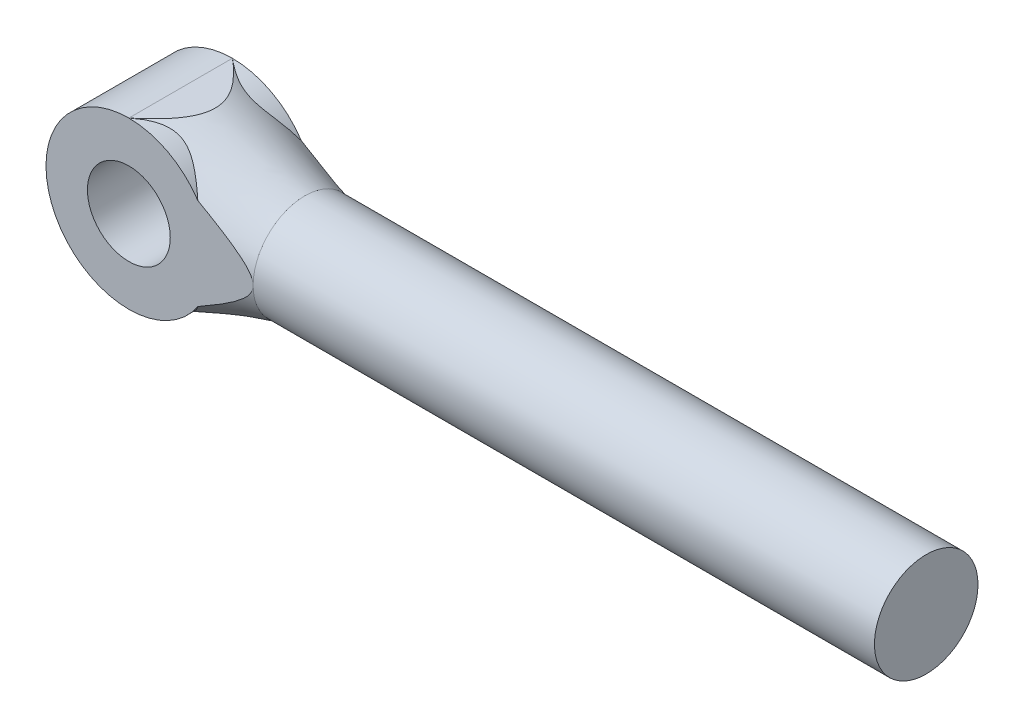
ISO-10303-21;
HEADER;
FILE_DESCRIPTION(('STEP AP214'),'2;1');
FILE_NAME('part.step','',(''),(''),'','','');
FILE_SCHEMA(('AUTOMOTIVE_DESIGN { 1 0 10303 214 1 1 1 1 }'));
ENDSEC;
DATA;
#1=APPLICATION_CONTEXT('core data for automotive mechanical design processes');
#2=APPLICATION_PROTOCOL_DEFINITION('international standard','automotive_design',2000,#1);
#3=PRODUCT_CONTEXT('',#1,'mechanical');
#4=PRODUCT('Part','Part','',(#3));
#5=PRODUCT_RELATED_PRODUCT_CATEGORY('part','',(#4));
#6=PRODUCT_DEFINITION_FORMATION('','',#4);
#7=PRODUCT_DEFINITION_CONTEXT('part definition',#1,'design');
#8=PRODUCT_DEFINITION('design','',#6,#7);
#9=PRODUCT_DEFINITION_SHAPE('','',#8);
#10=(LENGTH_UNIT() NAMED_UNIT(*) SI_UNIT(.MILLI.,.METRE.));
#11=(NAMED_UNIT(*) PLANE_ANGLE_UNIT() SI_UNIT($,.RADIAN.));
#12=(NAMED_UNIT(*) SI_UNIT($,.STERADIAN.) SOLID_ANGLE_UNIT());
#13=UNCERTAINTY_MEASURE_WITH_UNIT(LENGTH_MEASURE(1.E-05),#10,'distance_accuracy_value','');
#14=(GEOMETRIC_REPRESENTATION_CONTEXT(3) GLOBAL_UNCERTAINTY_ASSIGNED_CONTEXT((#13)) GLOBAL_UNIT_ASSIGNED_CONTEXT((#10,
#11,#12)) REPRESENTATION_CONTEXT('',''));
#15=CARTESIAN_POINT('',(0.,0.,0.));
#16=DIRECTION('',(0.,0.,1.));
#17=DIRECTION('',(1.,0.,0.));
#18=AXIS2_PLACEMENT_3D('',#15,#16,#17);
#19=CARTESIAN_POINT('',(0.,13.5412381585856,-21.0151104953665));
#20=CARTESIAN_POINT('',(-60.,43.349038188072,-18.5973355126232));
#21=CARTESIAN_POINT('',(0.,-28.4889828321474,-48.0975868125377));
#22=CARTESIAN_POINT('',(-60.,6.15436716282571,-105.295411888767));
#23=CARTESIAN_POINT('',(0.,-55.5714591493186,-6.0673658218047));
#24=CARTESIAN_POINT('',(-60.,-80.5437092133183,-68.1007408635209));
#25=CARTESIAN_POINT('',(0.,-13.5412381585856,21.0151104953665));
#26=CARTESIAN_POINT('',(-60.,-43.349038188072,18.5973355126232));
#27=CARTESIAN_POINT('',(0.,28.4889828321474,48.0975868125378));
#28=CARTESIAN_POINT('',(-60.,-6.1543671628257,105.295411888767));
#29=CARTESIAN_POINT('',(0.,55.5714591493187,6.06736582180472));
#30=CARTESIAN_POINT('',(-60.,80.5437092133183,68.1007408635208));
#31=CARTESIAN_POINT('',(0.,13.5412381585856,-21.0151104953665));
#32=CARTESIAN_POINT('',(-60.,43.349038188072,-18.5973355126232));
#33=(BOUNDED_SURFACE() B_SPLINE_SURFACE(3,1,((#19,#20),(#21,#22),(#23,#24),(#25,#26),(#27,#28),
(#29,#30),(#31,#32)),.UNSPECIFIED.,.T.,.F.,.F.) B_SPLINE_SURFACE_WITH_KNOTS((4,3,4),(2,2),(0.,
0.5,1.),(0.,1.),.UNSPECIFIED.) GEOMETRIC_REPRESENTATION_ITEM() RATIONAL_B_SPLINE_SURFACE(((1.,
1.),(0.333333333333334,0.333333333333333),(0.333333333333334,0.333333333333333),(1.,1.),
(0.333333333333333,0.333333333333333),(0.333333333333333,0.333333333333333),(1.,1.))) REPRESENTATION_ITEM('') SURFACE());
#34=CARTESIAN_POINT('',(-60.,-40.,-25.));
#35=CARTESIAN_POINT('',(-59.7969987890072,-39.9999989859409,-24.831217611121));
#36=CARTESIAN_POINT('',(-59.5933256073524,-39.9984547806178,-24.6632475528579));
#37=CARTESIAN_POINT('',(-59.1845462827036,-39.992209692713,-24.3291068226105));
#38=CARTESIAN_POINT('',(-58.9794400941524,-39.987508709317,-24.1629362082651));
#39=CARTESIAN_POINT('',(-58.3579919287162,-39.9684467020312,-23.6642996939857));
#40=CARTESIAN_POINT('',(-57.9393294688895,-39.9491234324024,-23.3348860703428));
#41=CARTESIAN_POINT('',(-57.0928591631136,-39.896482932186,-22.6842559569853));
#42=CARTESIAN_POINT('',(-56.6650137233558,-39.8630894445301,-22.3630944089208));
#43=CARTESIAN_POINT('',(-55.800699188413,-39.781336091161,-21.7325893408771));
#44=CARTESIAN_POINT('',(-55.3642140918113,-39.732945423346,-21.4232716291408));
#45=CARTESIAN_POINT('',(-54.4640590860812,-39.6177718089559,-20.8075106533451));
#46=CARTESIAN_POINT('',(-54.0000177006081,-39.5503012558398,-20.5017347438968));
#47=CARTESIAN_POINT('',(-53.0626359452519,-39.3966750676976,-19.9121253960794));
#48=CARTESIAN_POINT('',(-52.5893196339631,-39.3105631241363,-19.6282427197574));
#49=CARTESIAN_POINT('',(-51.6329701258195,-39.1181552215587,-19.0879231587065));
#50=CARTESIAN_POINT('',(-51.1499682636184,-39.0119171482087,-18.8314107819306));
#51=CARTESIAN_POINT('',(-50.1733782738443,-38.7774305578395,-18.3519675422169));
#52=CARTESIAN_POINT('',(-49.6798061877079,-38.6492135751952,-18.1289894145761));
#53=CARTESIAN_POINT('',(-48.899664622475,-38.4300421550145,-17.812178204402));
#54=CARTESIAN_POINT('',(-48.6164659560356,-38.3471473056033,-17.7043661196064));
#55=CARTESIAN_POINT('',(-48.0471950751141,-38.1735380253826,-17.5032457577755));
#56=CARTESIAN_POINT('',(-47.7611221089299,-38.0828214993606,-17.4099413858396));
#57=CARTESIAN_POINT('',(-47.1868280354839,-37.8934563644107,-17.2392785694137));
#58=CARTESIAN_POINT('',(-46.8986068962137,-37.7948076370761,-17.1619203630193));
#59=CARTESIAN_POINT('',(-46.3244951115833,-37.5908524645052,-17.02524004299));
#60=CARTESIAN_POINT('',(-46.0386204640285,-37.4856448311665,-16.9657042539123));
#61=CARTESIAN_POINT('',(-45.4666220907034,-37.267607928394,-16.8642774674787));
#62=CARTESIAN_POINT('',(-45.1804983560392,-37.1547783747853,-16.822387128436));
#63=CARTESIAN_POINT('',(-44.60919529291,-36.9217860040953,-16.7567661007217));
#64=CARTESIAN_POINT('',(-44.3240158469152,-36.8016241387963,-16.7330330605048));
#65=CARTESIAN_POINT('',(-43.7545534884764,-36.5538273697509,-16.7037002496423));
#66=CARTESIAN_POINT('',(-43.4702794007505,-36.4261631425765,-16.6981772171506));
#67=CARTESIAN_POINT('',(-42.9049509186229,-36.1642967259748,-16.7050415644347));
#68=CARTESIAN_POINT('',(-42.6238969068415,-36.0300937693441,-16.7174310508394));
#69=CARTESIAN_POINT('',(-42.0660530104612,-35.755701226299,-16.7592499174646));
#70=CARTESIAN_POINT('',(-41.789262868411,-35.6155120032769,-16.7886782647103));
#71=CARTESIAN_POINT('',(-41.2390881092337,-35.3288124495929,-16.8635877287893));
#72=CARTESIAN_POINT('',(-40.9657334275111,-35.1822695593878,-16.9091630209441));
#73=CARTESIAN_POINT('',(-40.4246774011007,-34.8841248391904,-17.0148859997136));
#74=CARTESIAN_POINT('',(-40.1569761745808,-34.7325229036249,-17.0750339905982));
#75=CARTESIAN_POINT('',(-39.6275650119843,-34.4246666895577,-17.2083560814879));
#76=CARTESIAN_POINT('',(-39.3658554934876,-34.2684120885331,-17.2815310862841));
#77=CARTESIAN_POINT('',(-38.7783695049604,-33.908569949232,-17.460780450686));
#78=CARTESIAN_POINT('',(-38.4544899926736,-33.7036493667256,-17.5703930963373));
#79=CARTESIAN_POINT('',(-37.8165993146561,-33.2872632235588,-17.8051648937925));
#80=CARTESIAN_POINT('',(-37.5025920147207,-33.0757951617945,-17.9303300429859));
#81=CARTESIAN_POINT('',(-36.8841445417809,-32.6465769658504,-18.1935066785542));
#82=CARTESIAN_POINT('',(-36.5797099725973,-32.4288232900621,-18.3315255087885));
#83=CARTESIAN_POINT('',(-35.9802171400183,-31.9873197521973,-18.6179413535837));
#84=CARTESIAN_POINT('',(-35.6851594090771,-31.7635695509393,-18.7663389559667));
#85=CARTESIAN_POINT('',(-35.1030994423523,-31.3094400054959,-19.0719046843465));
#86=CARTESIAN_POINT('',(-34.816125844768,-31.0790418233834,-19.2290992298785));
#87=CARTESIAN_POINT('',(-34.2509366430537,-30.6124152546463,-19.5499428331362));
#88=CARTESIAN_POINT('',(-33.9727170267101,-30.3761896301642,-19.7135888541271));
#89=CARTESIAN_POINT('',(-33.4245580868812,-29.8977959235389,-20.045831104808));
#90=CARTESIAN_POINT('',(-33.1546176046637,-29.6556286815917,-20.2144266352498));
#91=CARTESIAN_POINT('',(-32.6226504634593,-29.1652463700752,-20.5552541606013));
#92=CARTESIAN_POINT('',(-32.3606237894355,-28.9170313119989,-20.7274861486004));
#93=CARTESIAN_POINT('',(-31.8478730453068,-28.418020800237,-21.0719692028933));
#94=CARTESIAN_POINT('',(-31.5970414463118,-28.1673117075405,-21.2441854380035));
#95=CARTESIAN_POINT('',(-31.102601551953,-27.6598240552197,-21.5900517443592));
#96=CARTESIAN_POINT('',(-30.8589933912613,-27.4030453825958,-21.7637018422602));
#97=CARTESIAN_POINT('',(-30.3788547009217,-26.8833203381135,-22.1115661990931));
#98=CARTESIAN_POINT('',(-30.1423242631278,-26.6203738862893,-22.2857804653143));
#99=CARTESIAN_POINT('',(-29.6762498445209,-26.0882210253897,-22.6339877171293));
#100=CARTESIAN_POINT('',(-29.446705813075,-25.819014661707,-22.807980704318));
#101=CARTESIAN_POINT('',(-28.9969678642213,-25.2771564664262,-23.1531810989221));
#102=CARTESIAN_POINT('',(-28.7767002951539,-25.0045720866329,-23.3243984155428));
#103=CARTESIAN_POINT('',(-28.3429549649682,-24.453109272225,-23.6652798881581));
#104=CARTESIAN_POINT('',(-28.1294771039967,-24.1742309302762,-23.8349440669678));
#105=CARTESIAN_POINT('',(-27.7093393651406,-23.6101025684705,-24.1721261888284));
#106=CARTESIAN_POINT('',(-27.5026795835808,-23.3248524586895,-24.3396441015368));
#107=CARTESIAN_POINT('',(-27.0962446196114,-22.747908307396,-24.6719860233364));
#108=CARTESIAN_POINT('',(-26.8964700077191,-22.4562137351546,-24.8368098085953));
#109=CARTESIAN_POINT('',(-26.7001868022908,-22.1612824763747,-25.));
#110=B_SPLINE_CURVE_WITH_KNOTS('',3,(#34,#35,#36,#37,#38,#39,#40,#41,#42,#43,#44,#45,#46,#47,
#48,#49,#50,#51,#52,#53,#54,#55,#56,#57,#58,#59,#60,#61,#62,#63,#64,#65,#66,#67,#68,#69,#70,#71,
#72,#73,#74,#75,#76,#77,#78,#79,#80,#81,#82,#83,#84,#85,#86,#87,#88,#89,#90,#91,#92,#93,#94,#95,
#96,#97,#98,#99,#100,#101,#102,#103,#104,#105,#106,#107,#108,#109),.UNSPECIFIED.,.F.,.F.,(4,2,2,
2,2,2,2,2,2,2,2,2,2,2,2,2,2,2,2,2,2,2,2,2,2,2,2,2,2,2,2,2,2,2,2,2,2,4),(0.,0.791992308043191,
1.58400991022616,3.18291919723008,4.79060796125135,6.40162082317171,8.08035155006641,
9.75518948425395,11.4252815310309,13.0929971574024,14.0351007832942,14.9774575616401,
15.9198284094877,16.8504013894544,17.7810090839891,18.711496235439,19.6458995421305,
20.5804127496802,21.5148693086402,22.4548682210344,23.3948867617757,24.3349706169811,
25.5302864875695,26.7260647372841,27.922530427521,29.1190639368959,30.3194069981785,
31.5191916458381,32.7188076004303,33.9184212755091,35.1010416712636,36.2836841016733,
37.4663418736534,38.6489910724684,39.8190162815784,40.9890242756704,42.1590487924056,
43.3291700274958),.UNSPECIFIED.);
#111=CARTESIAN_POINT('',(-60.,-40.,-25.));
#112=VERTEX_POINT('',#111);
#113=CARTESIAN_POINT('',(-26.7001868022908,-22.1612824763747,-25.0000009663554));
#114=VERTEX_POINT('',#113);
#115=EDGE_CURVE('E12',#112,#114,#110,.T.);
#116=CARTESIAN_POINT('',(-60.,-39.9999993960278,-25.0000009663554));
#117=CARTESIAN_POINT('',(-59.0503450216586,-39.5065000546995,-25.0000009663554));
#118=CARTESIAN_POINT('',(-58.1009848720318,-39.0124328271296,-25.0000009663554));
#119=CARTESIAN_POINT('',(-56.202900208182,-38.0229923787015,-25.0000009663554));
#120=CARTESIAN_POINT('',(-55.2541757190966,-37.527619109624,-25.0000009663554));
#121=CARTESIAN_POINT('',(-53.3574571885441,-36.5354216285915,-25.0000009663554));
#122=CARTESIAN_POINT('',(-52.409463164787,-36.038597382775,-25.0000009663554));
#123=CARTESIAN_POINT('',(-50.5143178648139,-35.0433199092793,-25.0000009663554));
#124=CARTESIAN_POINT('',(-49.5671665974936,-34.5448666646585,-25.0000009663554));
#125=CARTESIAN_POINT('',(-47.6740890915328,-33.5462550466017,-25.0000009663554));
#126=CARTESIAN_POINT('',(-46.7281625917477,-33.0460971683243,-25.0000009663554));
#127=CARTESIAN_POINT('',(-44.8374305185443,-32.0436914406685,-25.0000009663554));
#128=CARTESIAN_POINT('',(-43.8926249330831,-31.5414436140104,-25.0000009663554));
#129=CARTESIAN_POINT('',(-42.0043120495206,-30.53455492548,-25.0000009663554));
#130=CARTESIAN_POINT('',(-41.0608047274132,-30.029914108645,-25.0000009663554));
#131=CARTESIAN_POINT('',(-39.1753022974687,-29.0178687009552,-25.0000009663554));
#132=CARTESIAN_POINT('',(-38.2333071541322,-28.5104641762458,-25.0000009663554));
#133=CARTESIAN_POINT('',(-36.0372394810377,-27.322698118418,-25.0000009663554));
#134=CARTESIAN_POINT('',(-34.7838446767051,-26.641082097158,-25.0000009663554));
#135=CARTESIAN_POINT('',(-32.2809065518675,-25.2707211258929,-25.0000009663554));
#136=CARTESIAN_POINT('',(-31.0313633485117,-24.581975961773,-25.0000009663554));
#137=CARTESIAN_POINT('',(-28.537108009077,-23.1954311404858,-25.0000009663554));
#138=CARTESIAN_POINT('',(-27.2923964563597,-22.4976304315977,-25.0000009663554));
#139=CARTESIAN_POINT('',(-25.429689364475,-21.4418852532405,-25.0000009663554));
#140=CARTESIAN_POINT('',(-24.8092249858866,-21.0882956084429,-25.0000009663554));
#141=CARTESIAN_POINT('',(-23.5702217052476,-20.3777602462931,-25.0000009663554));
#142=CARTESIAN_POINT('',(-22.9516827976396,-20.0208145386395,-25.0000009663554));
#143=CARTESIAN_POINT('',(-21.7169137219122,-19.3030776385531,-25.0000009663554));
#144=CARTESIAN_POINT('',(-21.1006833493,-18.94228679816,-25.0000009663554));
#145=CARTESIAN_POINT('',(-19.8708937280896,-18.2161848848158,-25.0000009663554));
#146=CARTESIAN_POINT('',(-19.2573344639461,-17.8508738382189,-25.0000009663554));
#147=CARTESIAN_POINT('',(-18.0335615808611,-17.1150178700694,-25.0000009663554));
#148=CARTESIAN_POINT('',(-17.4233471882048,-16.7444742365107,-25.0000009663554));
#149=CARTESIAN_POINT('',(-16.2068069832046,-15.9970653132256,-25.0000009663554));
#150=CARTESIAN_POINT('',(-15.6004811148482,-15.6202001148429,-25.0000009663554));
#151=CARTESIAN_POINT('',(-14.5385078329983,-14.9507970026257,-25.0000009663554));
#152=CARTESIAN_POINT('',(-14.0818403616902,-14.6598781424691,-25.0000009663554));
#153=CARTESIAN_POINT('',(-13.171762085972,-14.072917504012,-25.0000009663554));
#154=CARTESIAN_POINT('',(-12.7183514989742,-13.776875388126,-25.0000009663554));
#155=CARTESIAN_POINT('',(-11.8153727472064,-13.1787319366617,-25.0000009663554));
#156=CARTESIAN_POINT('',(-11.3658055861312,-12.8766290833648,-25.0000009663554));
#157=CARTESIAN_POINT('',(-10.4712697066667,-12.2651674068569,-25.0000009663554));
#158=CARTESIAN_POINT('',(-10.0263035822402,-11.9558047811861,-25.0000009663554));
#159=CARTESIAN_POINT('',(-9.14237049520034,-11.328556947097,-25.0000009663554));
#160=CARTESIAN_POINT('',(-8.70340380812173,-11.0106713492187,-25.0000009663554));
#161=CARTESIAN_POINT('',(-7.83316641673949,-10.3646084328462,-25.0000009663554));
#162=CARTESIAN_POINT('',(-7.40189485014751,-10.0364322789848,-25.0000009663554));
#163=CARTESIAN_POINT('',(-6.54955124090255,-9.36758957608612,-25.0000009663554));
#164=CARTESIAN_POINT('',(-6.12847241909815,-9.02693173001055,-25.0000009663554));
#165=CARTESIAN_POINT('',(-5.50697536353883,-8.50412922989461,-25.0000009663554));
#166=CARTESIAN_POINT('',(-5.30154708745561,-8.3279383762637,-25.0000009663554));
#167=CARTESIAN_POINT('',(-4.89462764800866,-7.97107946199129,-25.0000009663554));
#168=CARTESIAN_POINT('',(-4.69313638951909,-7.79041150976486,-25.0000009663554));
#169=CARTESIAN_POINT('',(-4.18631665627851,-7.32427543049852,-25.0000009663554));
#170=CARTESIAN_POINT('',(-3.88417446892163,-7.03529812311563,-25.0000009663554));
#171=CARTESIAN_POINT('',(-3.44188188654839,-6.59081523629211,-25.0000009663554));
#172=CARTESIAN_POINT('',(-3.29622855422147,-6.44077086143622,-25.0000009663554));
#173=CARTESIAN_POINT('',(-3.00920940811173,-6.13664300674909,-25.0000009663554));
#174=CARTESIAN_POINT('',(-2.86784327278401,-5.98255983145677,-25.0000009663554));
#175=CARTESIAN_POINT('',(-2.59062540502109,-5.67050611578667,-25.0000009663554));
#176=CARTESIAN_POINT('',(-2.45475539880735,-5.51255185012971,-25.0000009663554));
#177=CARTESIAN_POINT('',(-2.18886347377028,-5.19176189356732,-25.0000009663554));
#178=CARTESIAN_POINT('',(-2.05884192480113,-5.02892589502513,-25.0000009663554));
#179=CARTESIAN_POINT('',(-1.80585919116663,-4.69807177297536,-25.0000009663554));
#180=CARTESIAN_POINT('',(-1.68289172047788,-4.53005847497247,-25.0000009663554));
#181=CARTESIAN_POINT('',(-1.44524296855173,-4.18829221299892,-25.0000009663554));
#182=CARTESIAN_POINT('',(-1.33055996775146,-4.01454045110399,-25.0000009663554));
#183=CARTESIAN_POINT('',(-1.11676287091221,-3.67004778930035,-25.0000009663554));
#184=CARTESIAN_POINT('',(-1.0171498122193,-3.49961802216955,-25.0000009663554));
#185=CARTESIAN_POINT('',(-0.828442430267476,-3.15300432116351,-25.0000009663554));
#186=CARTESIAN_POINT('',(-0.739347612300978,-2.97682065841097,-25.0000009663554));
#187=CARTESIAN_POINT('',(-0.573594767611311,-2.61876900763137,-25.0000009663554));
#188=CARTESIAN_POINT('',(-0.496930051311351,-2.43690414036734,-25.0000009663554));
#189=CARTESIAN_POINT('',(-0.358048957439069,-2.06775141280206,-25.0000009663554));
#190=CARTESIAN_POINT('',(-0.295828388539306,-1.88046514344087,-25.0000009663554));
#191=CARTESIAN_POINT('',(-0.187072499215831,-1.49834684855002,-25.0000009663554));
#192=CARTESIAN_POINT('',(-0.140782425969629,-1.30344422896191,-25.0000009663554));
#193=CARTESIAN_POINT('',(-0.067074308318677,-0.910076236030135,-25.0000009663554));
#194=CARTESIAN_POINT('',(-0.0396547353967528,-0.711611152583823,-25.0000009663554));
#195=CARTESIAN_POINT('',(-0.00497308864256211,-0.313094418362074,-25.0000009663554));
#196=CARTESIAN_POINT('',(0.00230783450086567,-0.113044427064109,-25.0000009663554));
#197=CARTESIAN_POINT('',(-0.00359875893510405,0.286744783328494,-25.0000009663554));
#198=CARTESIAN_POINT('',(-0.0167848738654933,0.486484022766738,-25.0000009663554));
#199=CARTESIAN_POINT('',(-0.059653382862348,0.855158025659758,-25.0000009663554));
#200=CARTESIAN_POINT('',(-0.0867028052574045,1.02440768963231,-25.0000009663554));
#201=CARTESIAN_POINT('',(-0.154433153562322,1.36016084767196,-25.0000009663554));
#202=CARTESIAN_POINT('',(-0.195115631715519,1.52666402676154,-25.0000009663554));
#203=CARTESIAN_POINT('',(-0.288931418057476,1.85617479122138,-25.0000009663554));
#204=CARTESIAN_POINT('',(-0.342070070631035,2.01918084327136,-25.0000009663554));
#205=CARTESIAN_POINT('',(-0.459444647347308,2.34113469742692,-25.0000009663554));
#206=CARTESIAN_POINT('',(-0.523682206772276,2.50008189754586,-25.0000009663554));
#207=CARTESIAN_POINT('',(-0.711940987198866,2.92718868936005,-25.0000009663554));
#208=CARTESIAN_POINT('',(-0.845580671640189,3.19112678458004,-25.0000009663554));
#209=CARTESIAN_POINT('',(-1.13552962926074,3.70625135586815,-25.0000009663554));
#210=CARTESIAN_POINT('',(-1.29185661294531,3.9574276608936,-25.0000009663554));
#211=CARTESIAN_POINT('',(-1.6226918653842,4.4488263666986,-25.0000009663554));
#212=CARTESIAN_POINT('',(-1.79726866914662,4.6890022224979,-25.0000009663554));
#213=CARTESIAN_POINT('',(-2.16009257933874,5.15853876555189,-25.0000009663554));
#214=CARTESIAN_POINT('',(-2.34833371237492,5.38790410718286,-25.0000009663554));
#215=CARTESIAN_POINT('',(-2.70305456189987,5.79945699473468,-25.0000009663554));
#216=CARTESIAN_POINT('',(-2.86786900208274,5.98309083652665,-25.0000009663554));
#217=CARTESIAN_POINT('',(-3.20372229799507,6.34459512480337,-25.0000009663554));
#218=CARTESIAN_POINT('',(-3.3747617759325,6.52246499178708,-25.0000009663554));
#219=CARTESIAN_POINT('',(-3.72221699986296,6.87324983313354,-25.0000009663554));
#220=CARTESIAN_POINT('',(-3.89863850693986,7.04615908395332,-25.0000009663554));
#221=CARTESIAN_POINT('',(-4.25587775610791,7.38738328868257,-25.0000009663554));
#222=CARTESIAN_POINT('',(-4.43669577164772,7.55569795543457,-25.0000009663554));
#223=CARTESIAN_POINT('',(-4.98553478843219,8.05523487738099,-25.0000009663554));
#224=CARTESIAN_POINT('',(-5.35917635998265,8.38028899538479,-25.0000009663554));
#225=CARTESIAN_POINT('',(-6.11806691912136,9.01765734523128,-25.0000009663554));
#226=CARTESIAN_POINT('',(-6.50333304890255,9.3299509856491,-25.0000009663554));
#227=CARTESIAN_POINT('',(-7.28233379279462,9.94371809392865,-25.0000009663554));
#228=CARTESIAN_POINT('',(-7.67606799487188,10.2451920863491,-25.0000009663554));
#229=CARTESIAN_POINT('',(-8.47351928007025,10.8417165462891,-25.0000009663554));
#230=CARTESIAN_POINT('',(-8.87729243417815,11.1366917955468,-25.0000009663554));
#231=CARTESIAN_POINT('',(-9.68953359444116,11.7185685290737,-25.0000009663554));
#232=CARTESIAN_POINT('',(-10.0979921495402,12.0054832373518,-25.0000009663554));
#233=CARTESIAN_POINT('',(-10.918854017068,12.5726461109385,-25.0000009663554));
#234=CARTESIAN_POINT('',(-11.331252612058,12.8529011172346,-25.0000009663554));
#235=CARTESIAN_POINT('',(-12.1594478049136,13.4078505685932,-25.0000009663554));
#236=CARTESIAN_POINT('',(-12.5752424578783,13.6825479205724,-25.0000009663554));
#237=CARTESIAN_POINT('',(-13.4098300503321,14.2272693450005,-25.0000009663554));
#238=CARTESIAN_POINT('',(-13.8286227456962,14.497293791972,-25.0000009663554));
#239=CARTESIAN_POINT('',(-14.7084238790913,15.0586057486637,-25.0000009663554));
#240=CARTESIAN_POINT('',(-15.1696862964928,15.3494948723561,-25.0000009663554));
#241=CARTESIAN_POINT('',(-16.0948151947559,15.9271053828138,-25.0000009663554));
#242=CARTESIAN_POINT('',(-16.5586816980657,16.2138267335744,-25.0000009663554));
#243=CARTESIAN_POINT('',(-17.9541736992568,17.0689313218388,-25.0000009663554));
#244=CARTESIAN_POINT('',(-18.8891220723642,17.6318937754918,-25.0000009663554));
#245=CARTESIAN_POINT('',(-20.7659868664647,18.746911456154,-25.0000009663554));
#246=CARTESIAN_POINT('',(-21.7079059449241,19.2989621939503,-25.0000009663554));
#247=CARTESIAN_POINT('',(-23.5969011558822,20.3942852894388,-25.0000009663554));
#248=CARTESIAN_POINT('',(-24.5439775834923,20.9375571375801,-25.0000009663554));
#249=CARTESIAN_POINT('',(-26.4355484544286,22.0132500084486,-25.0000009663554));
#250=CARTESIAN_POINT('',(-27.3800149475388,22.5457202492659,-25.0000009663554));
#251=CARTESIAN_POINT('',(-29.27192849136,23.6048051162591,-25.0000009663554));
#252=CARTESIAN_POINT('',(-30.2193747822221,24.1314211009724,-25.0000009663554));
#253=CARTESIAN_POINT('',(-32.11677756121,25.1798337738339,-25.0000009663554));
#254=CARTESIAN_POINT('',(-33.0667337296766,25.7016310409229,-25.0000009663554));
#255=CARTESIAN_POINT('',(-34.9688084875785,26.7412201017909,-25.0000009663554));
#256=CARTESIAN_POINT('',(-35.9209270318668,27.2590119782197,-25.0000009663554));
#257=CARTESIAN_POINT('',(-37.8292822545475,28.2924424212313,-25.0000009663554));
#258=CARTESIAN_POINT('',(-38.7855233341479,28.8080728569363,-25.0000009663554));
#259=CARTESIAN_POINT('',(-40.6995743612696,29.8364144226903,-25.0000009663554));
#260=CARTESIAN_POINT('',(-41.6573843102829,30.349125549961,-25.0000009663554));
#261=CARTESIAN_POINT('',(-44.5329793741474,31.8835812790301,-25.0000009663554));
#262=CARTESIAN_POINT('',(-46.4527724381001,32.9015632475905,-25.0000009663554));
#263=CARTESIAN_POINT('',(-50.3087624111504,34.9364517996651,-25.0000009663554));
#264=CARTESIAN_POINT('',(-52.2449852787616,35.9533091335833,-25.0000009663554));
#265=CARTESIAN_POINT('',(-55.1515886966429,37.4740290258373,-25.0000009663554));
#266=CARTESIAN_POINT('',(-56.1207883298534,37.9801505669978,-25.0000009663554));
#267=CARTESIAN_POINT('',(-58.0598890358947,38.9910459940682,-25.0000009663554));
#268=CARTESIAN_POINT('',(-59.0297901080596,39.4958198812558,-25.0000009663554));
#269=CARTESIAN_POINT('',(-60.,39.9999993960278,-25.0000009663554));
#270=B_SPLINE_CURVE_WITH_KNOTS('',3,(#116,#117,#118,#119,#120,#121,#122,#123,#124,#125,#126,
#127,#128,#129,#130,#131,#132,#133,#134,#135,#136,#137,#138,#139,#140,#141,#142,#143,#144,#145,
#146,#147,#148,#149,#150,#151,#152,#153,#154,#155,#156,#157,#158,#159,#160,#161,#162,#163,#164,
#165,#166,#167,#168,#169,#170,#171,#172,#173,#174,#175,#176,#177,#178,#179,#180,#181,#182,#183,
#184,#185,#186,#187,#188,#189,#190,#191,#192,#193,#194,#195,#196,#197,#198,#199,#200,#201,#202,
#203,#204,#205,#206,#207,#208,#209,#210,#211,#212,#213,#214,#215,#216,#217,#218,#219,#220,#221,
#222,#223,#224,#225,#226,#227,#228,#229,#230,#231,#232,#233,#234,#235,#236,#237,#238,#239,#240,
#241,#242,#243,#244,#245,#246,#247,#248,#249,#250,#251,#252,#253,#254,#255,#256,#257,#258,#259,
#260,#261,#262,#263,#264,#265,#266,#267,#268,#269),.UNSPECIFIED.,.F.,.F.,(4,2,2,2,2,2,2,2,2,2,2,
2,2,2,2,2,2,2,2,2,2,2,2,2,2,2,2,2,2,2,2,2,2,2,2,2,2,2,2,2,2,2,2,2,2,2,2,2,2,2,2,2,2,2,2,2,2,2,2,
2,2,2,2,2,2,2,2,2,2,2,2,2,2,2,2,2,4),(0.,3.21068166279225,6.42148357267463,9.63236102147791,
12.8432719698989,16.0533185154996,19.2633302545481,22.4732818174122,25.6831568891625,
29.963370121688,34.2437122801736,38.5245560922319,40.6669798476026,42.8093974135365,
44.9516204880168,47.0938310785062,49.2355232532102,51.377184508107,53.0015366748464,
54.6259962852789,56.250867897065,57.8766104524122,59.5024274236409,61.1280610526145,
62.7525819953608,63.5644329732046,64.3762643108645,65.6300498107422,66.2573238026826,
66.8845506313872,67.5094839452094,68.1344567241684,68.7588636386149,69.3831405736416,
69.9750434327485,70.5669184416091,71.1584738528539,71.7498573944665,72.3499757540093,
72.9500454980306,73.549553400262,74.1490202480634,74.6626343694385,75.1763069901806,
75.6902004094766,76.2041696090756,77.0901460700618,77.9768179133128,78.8669480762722,
79.7566914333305,80.4967805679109,81.2369438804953,81.9779293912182,82.7189611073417,
84.2042572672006,85.6918625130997,87.1793955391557,88.6794223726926,90.1768245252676,
91.6726154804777,93.1676027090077,94.6624695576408,96.2984183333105,97.9343812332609,
101.208330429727,104.483599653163,107.759058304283,111.011706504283,114.263583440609,
117.515064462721,120.766478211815,124.025681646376,127.284888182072,133.803837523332,
140.364817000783,143.644993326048,146.925166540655),.UNSPECIFIED.);
#271=CARTESIAN_POINT('',(-4.10836598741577E-06,0.,-25.0000009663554));
#272=VERTEX_POINT('',#271);
#273=EDGE_CURVE('E123',#114,#272,#270,.T.);
#274=CARTESIAN_POINT('',(0.,0.,0.));
#275=DIRECTION('',(-1.,0.,0.));
#276=DIRECTION('',(0.,0.,1.));
#277=AXIS2_PLACEMENT_3D('',#274,#275,#276);
#278=CIRCLE('',#277,25.);
#279=CARTESIAN_POINT('',(-3.70451738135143E-06,0.,25.0000008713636));
#280=VERTEX_POINT('',#279);
#281=EDGE_CURVE('E188',#272,#280,#278,.T.);
#282=CARTESIAN_POINT('',(-60.,39.9999994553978,25.0000008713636));
#283=CARTESIAN_POINT('',(-59.0503450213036,39.5065001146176,25.0000008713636));
#284=CARTESIAN_POINT('',(-58.1009848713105,39.012432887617,25.0000008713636));
#285=CARTESIAN_POINT('',(-56.2029002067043,38.022992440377,25.0000008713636));
#286=CARTESIAN_POINT('',(-55.2541757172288,37.5276191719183,25.0000008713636));
#287=CARTESIAN_POINT('',(-53.3574571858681,36.5354216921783,25.0000008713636));
#288=CARTESIAN_POINT('',(-52.4094631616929,36.0385974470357,25.0000008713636));
#289=CARTESIAN_POINT('',(-50.5143178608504,35.0433199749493,25.0000008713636));
#290=CARTESIAN_POINT('',(-49.5671665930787,34.5448667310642,25.0000008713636));
#291=CARTESIAN_POINT('',(-47.6740890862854,33.5462551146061,25.0000008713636));
#292=CARTESIAN_POINT('',(-46.7281625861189,33.046097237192,25.0000008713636));
#293=CARTESIAN_POINT('',(-44.8374305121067,32.0436915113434,25.0000008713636));
#294=CARTESIAN_POINT('',(-43.8926249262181,31.5414436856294,25.0000008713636));
#295=CARTESIAN_POINT('',(-42.0043120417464,30.5345549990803,25.0000008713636));
#296=CARTESIAN_POINT('',(-41.0608047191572,30.0299141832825,25.0000008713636));
#297=CARTESIAN_POINT('',(-39.1753022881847,29.017868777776,25.0000008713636));
#298=CARTESIAN_POINT('',(-38.2333071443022,28.5104642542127,25.0000008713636));
#299=CARTESIAN_POINT('',(-36.0372394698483,27.3226981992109,25.0000008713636));
#300=CARTESIAN_POINT('',(-34.7838446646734,26.641082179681,25.0000008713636));
#301=CARTESIAN_POINT('',(-32.2809065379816,25.270721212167,25.0000008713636));
#302=CARTESIAN_POINT('',(-31.0313633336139,24.5819760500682,25.0000008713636));
#303=CARTESIAN_POINT('',(-28.537107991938,23.1954312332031,25.0000008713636));
#304=CARTESIAN_POINT('',(-27.2923964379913,22.497630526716,25.0000008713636));
#305=CARTESIAN_POINT('',(-25.4296893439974,21.4418853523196,25.0000008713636));
#306=CARTESIAN_POINT('',(-24.8092249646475,21.0882957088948,25.0000008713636));
#307=CARTESIAN_POINT('',(-23.5702216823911,20.3777603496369,25.0000008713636));
#308=CARTESIAN_POINT('',(-22.9516827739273,20.0208146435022,25.0000008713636));
#309=CARTESIAN_POINT('',(-21.7169136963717,19.3030777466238,25.0000008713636));
#310=CARTESIAN_POINT('',(-21.1006833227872,18.9422869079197,25.0000008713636));
#311=CARTESIAN_POINT('',(-19.8708936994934,18.216184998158,25.0000008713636));
#312=CARTESIAN_POINT('',(-19.2573344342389,17.8508739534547,25.0000008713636));
#313=CARTESIAN_POINT('',(-18.0335615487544,17.115017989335,25.0000008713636));
#314=CARTESIAN_POINT('',(-17.4233471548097,16.7444743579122,25.0000008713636));
#315=CARTESIAN_POINT('',(-16.2068069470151,15.9970654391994,25.0000008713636));
#316=CARTESIAN_POINT('',(-15.6004810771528,15.6202002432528,25.0000008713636));
#317=CARTESIAN_POINT('',(-14.5385077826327,14.9507971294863,25.0000008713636));
#318=CARTESIAN_POINT('',(-14.0818403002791,14.6598782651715,25.0000008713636));
#319=CARTESIAN_POINT('',(-13.1717620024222,14.0729176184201,25.0000008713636));
#320=CARTESIAN_POINT('',(-12.7183514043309,13.7768754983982,25.0000008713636));
#321=CARTESIAN_POINT('',(-11.8153726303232,13.1787320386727,25.0000008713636));
#322=CARTESIAN_POINT('',(-11.3658054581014,12.8766291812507,25.0000008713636));
#323=CARTESIAN_POINT('',(-10.4712695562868,12.2651674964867,25.0000008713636));
#324=CARTESIAN_POINT('',(-10.0263034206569,11.955804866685,25.0000008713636));
#325=CARTESIAN_POINT('',(-9.1423703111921,11.3285570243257,25.0000008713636));
#326=CARTESIAN_POINT('',(-8.70340361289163,11.0106714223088,25.0000008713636));
#327=CARTESIAN_POINT('',(-7.83316619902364,10.3646084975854,25.0000008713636));
#328=CARTESIAN_POINT('',(-7.40189462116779,10.0364323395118,25.0000008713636));
#329=CARTESIAN_POINT('',(-6.54955098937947,9.36758962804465,25.0000008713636));
#330=CARTESIAN_POINT('',(-6.12847215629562,9.02693177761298,25.0000008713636));
#331=CARTESIAN_POINT('',(-5.50697508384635,8.50412927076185,25.0000008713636));
#332=CARTESIAN_POINT('',(-5.30154680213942,8.32793841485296,25.0000008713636));
#333=CARTESIAN_POINT('',(-4.89462735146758,7.97107949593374,25.0000008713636));
#334=CARTESIAN_POINT('',(-4.69313608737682,7.79041154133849,25.0000008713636));
#335=CARTESIAN_POINT('',(-4.18631634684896,7.32427546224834,25.0000008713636));
#336=CARTESIAN_POINT('',(-3.88417415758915,7.03529815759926,25.0000008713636));
#337=CARTESIAN_POINT('',(-3.44188157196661,6.59081527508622,25.0000008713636));
#338=CARTESIAN_POINT('',(-3.29622823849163,6.44077090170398,25.0000008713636));
#339=CARTESIAN_POINT('',(-3.00920908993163,6.13664305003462,25.0000008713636));
#340=CARTESIAN_POINT('',(-2.86784295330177,5.98255987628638,25.0000008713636));
#341=CARTESIAN_POINT('',(-2.59062508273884,5.67050616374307,25.0000008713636));
#342=CARTESIAN_POINT('',(-2.4547550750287,5.51255189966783,25.0000008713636));
#343=CARTESIAN_POINT('',(-2.1888631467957,5.1917619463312,25.0000008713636));
#344=CARTESIAN_POINT('',(-2.05884159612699,5.02892594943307,25.0000008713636));
#345=CARTESIAN_POINT('',(-1.80585885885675,4.69807183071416,25.0000008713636));
#346=CARTESIAN_POINT('',(-1.68289138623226,4.53005853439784,25.0000008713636));
#347=CARTESIAN_POINT('',(-1.4452426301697,4.18829227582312,25.0000008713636));
#348=CARTESIAN_POINT('',(-1.33055962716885,4.0145405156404,25.0000008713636));
#349=CARTESIAN_POINT('',(-1.11676252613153,3.67004785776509,25.0000008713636));
#350=CARTESIAN_POINT('',(-1.01714946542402,3.4996180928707,25.0000008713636));
#351=CARTESIAN_POINT('',(-0.828442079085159,3.15300439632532,25.0000008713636));
#352=CARTESIAN_POINT('',(-0.739347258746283,2.97682073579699,25.0000008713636));
#353=CARTESIAN_POINT('',(-0.573594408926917,2.61876908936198,25.0000008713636));
#354=CARTESIAN_POINT('',(-0.4969296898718,2.43690422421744,25.0000008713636));
#355=CARTESIAN_POINT('',(-0.358048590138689,2.06775150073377,25.0000008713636));
#356=CARTESIAN_POINT('',(-0.295828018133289,1.88046523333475,25.0000008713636));
#357=CARTESIAN_POINT('',(-0.187072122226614,1.49834694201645,25.0000008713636));
#358=CARTESIAN_POINT('',(-0.140782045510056,1.30344432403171,25.0000008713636));
#359=CARTESIAN_POINT('',(-0.0670739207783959,0.910076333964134,25.0000008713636));
#360=CARTESIAN_POINT('',(-0.0396543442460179,0.711611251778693,25.0000008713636));
#361=CARTESIAN_POINT('',(-0.00497269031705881,0.313094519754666,25.0000008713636));
#362=CARTESIAN_POINT('',(0.00230823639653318,0.113044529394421,25.0000008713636));
#363=CARTESIAN_POINT('',(-0.00359835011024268,-0.286744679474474,25.0000008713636));
#364=CARTESIAN_POINT('',(-0.0167844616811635,-0.48648391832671,25.0000008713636));
#365=CARTESIAN_POINT('',(-0.0596529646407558,-0.855157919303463,25.0000008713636));
#366=CARTESIAN_POINT('',(-0.0867023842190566,-1.02440758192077,25.0000008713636));
#367=CARTESIAN_POINT('',(-0.154432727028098,-1.36016073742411,25.0000008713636));
#368=CARTESIAN_POINT('',(-0.195115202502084,-1.52666391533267,25.0000008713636));
#369=CARTESIAN_POINT('',(-0.288930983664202,-1.85617467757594,25.0000008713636));
#370=CARTESIAN_POINT('',(-0.342069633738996,-2.01918072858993,25.0000008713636));
#371=CARTESIAN_POINT('',(-0.459444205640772,-2.34113458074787,25.0000008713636));
#372=CARTESIAN_POINT('',(-0.523681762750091,-2.50008177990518,25.0000008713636));
#373=CARTESIAN_POINT('',(-0.711940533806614,-2.92718856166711,25.0000008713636));
#374=CARTESIAN_POINT('',(-0.845580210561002,-3.19112664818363,25.0000008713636));
#375=CARTESIAN_POINT('',(-1.13552915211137,-3.70625120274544,25.0000008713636));
#376=CARTESIAN_POINT('',(-1.29185612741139,-3.95742749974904,25.0000008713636));
#377=CARTESIAN_POINT('',(-1.62269136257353,-4.44882618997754,25.0000008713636));
#378=CARTESIAN_POINT('',(-1.79726815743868,-4.68900203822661,25.0000008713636));
#379=CARTESIAN_POINT('',(-2.16009204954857,-5.1585385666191,25.0000008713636));
#380=CARTESIAN_POINT('',(-2.34833317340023,-5.38790390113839,25.0000008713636));
#381=CARTESIAN_POINT('',(-2.70305400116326,-5.79945677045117,25.0000008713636));
#382=CARTESIAN_POINT('',(-2.86786842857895,-5.98309060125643,25.0000008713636));
#383=CARTESIAN_POINT('',(-3.20372169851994,-6.34459486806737,25.0000008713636));
#384=CARTESIAN_POINT('',(-3.37476116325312,-6.5224647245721,25.0000008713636));
#385=CARTESIAN_POINT('',(-3.72221636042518,-6.87324954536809,25.0000008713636));
#386=CARTESIAN_POINT('',(-3.89863785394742,-7.046158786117,25.0000008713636));
#387=CARTESIAN_POINT('',(-4.25587707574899,-7.3873829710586,25.0000008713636));
#388=CARTESIAN_POINT('',(-4.43669507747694,-7.55569762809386,25.0000008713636));
#389=CARTESIAN_POINT('',(-4.98553405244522,-8.05523452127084,25.0000008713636));
#390=CARTESIAN_POINT('',(-5.35917559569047,-8.38028862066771,25.0000008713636));
#391=CARTESIAN_POINT('',(-6.1180660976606,-9.01765693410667,25.0000008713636));
#392=CARTESIAN_POINT('',(-6.50333219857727,-9.32995055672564,25.0000008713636));
#393=CARTESIAN_POINT('',(-7.28233288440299,-9.94371763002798,25.0000008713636));
#394=CARTESIAN_POINT('',(-7.67606705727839,-10.24519160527,25.0000008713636));
#395=CARTESIAN_POINT('',(-8.47351828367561,-10.8417160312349,25.0000008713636));
#396=CARTESIAN_POINT('',(-8.87729140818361,-11.1366912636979,25.0000008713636));
#397=CARTESIAN_POINT('',(-9.68953250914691,-11.7185679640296,25.0000008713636));
#398=CARTESIAN_POINT('',(-10.0979910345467,-12.0054826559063,25.0000008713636));
#399=CARTESIAN_POINT('',(-10.9188528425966,-12.5726454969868,25.0000008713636));
#400=CARTESIAN_POINT('',(-11.3312514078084,-12.8529004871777,25.0000008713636));
#401=CARTESIAN_POINT('',(-12.159446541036,-13.407849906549,25.0000008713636));
#402=CARTESIAN_POINT('',(-12.5752411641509,-13.682547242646,25.0000008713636));
#403=CARTESIAN_POINT('',(-13.4098286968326,-14.227268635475,25.0000008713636));
#404=CARTESIAN_POINT('',(-13.8286213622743,-14.4972930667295,25.0000008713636));
#405=CARTESIAN_POINT('',(-14.7084224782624,-15.05860501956,25.0000008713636));
#406=CARTESIAN_POINT('',(-15.1696849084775,-15.3494941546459,25.0000008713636));
#407=CARTESIAN_POINT('',(-16.0948138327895,-15.9271046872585,25.0000008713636));
#408=CARTESIAN_POINT('',(-16.5586803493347,-16.2138260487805,25.0000008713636));
#409=CARTESIAN_POINT('',(-17.9541723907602,-17.068930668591,25.0000008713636));
#410=CARTESIAN_POINT('',(-18.8891207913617,-17.6318931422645,25.0000008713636));
#411=CARTESIAN_POINT('',(-20.7659856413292,-18.7469108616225,25.0000008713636));
#412=CARTESIAN_POINT('',(-21.7079047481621,-19.2989616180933,25.0000008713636));
#413=CARTESIAN_POINT('',(-23.596900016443,-20.3942847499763,25.0000008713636));
#414=CARTESIAN_POINT('',(-24.5439764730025,-20.9375566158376,25.0000008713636));
#415=CARTESIAN_POINT('',(-26.4355474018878,-22.013249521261,25.0000008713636));
#416=CARTESIAN_POINT('',(-27.3800139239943,-22.5457197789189,25.0000008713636));
#417=CARTESIAN_POINT('',(-29.2719275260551,-23.6048046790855,25.0000008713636));
#418=CARTESIAN_POINT('',(-30.2193738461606,-24.1314206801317,25.0000008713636));
#419=CARTESIAN_POINT('',(-32.1167766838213,-25.1798333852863,25.0000008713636));
#420=CARTESIAN_POINT('',(-33.0667328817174,-25.7016306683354,25.0000008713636));
#421=CARTESIAN_POINT('',(-34.9688076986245,-26.7412197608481,25.0000008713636));
#422=CARTESIAN_POINT('',(-35.9209262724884,-27.2590116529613,25.0000008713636));
#423=CARTESIAN_POINT('',(-37.8292815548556,-28.292442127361,25.0000008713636));
#424=CARTESIAN_POINT('',(-38.7855226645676,-28.8080725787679,25.0000008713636));
#425=CARTESIAN_POINT('',(-40.6995737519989,-29.8364141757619,25.0000008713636));
#426=CARTESIAN_POINT('',(-41.6573837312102,-30.3491253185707,25.0000008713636));
#427=CARTESIAN_POINT('',(-44.5329788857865,-31.8835810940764,25.0000008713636));
#428=CARTESIAN_POINT('',(-46.4527720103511,-32.9015630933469,25.0000008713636));
#429=CARTESIAN_POINT('',(-50.3087621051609,-34.9364517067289,25.0000008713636));
#430=CARTESIAN_POINT('',(-52.2449850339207,-35.9533090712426,25.0000008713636));
#431=CARTESIAN_POINT('',(-55.1515885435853,-37.4740290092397,25.0000008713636));
#432=CARTESIAN_POINT('',(-56.1207882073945,-37.9801505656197,25.0000008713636));
#433=CARTESIAN_POINT('',(-58.0598889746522,-38.9910460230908,25.0000008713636));
#434=CARTESIAN_POINT('',(-59.0297900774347,-39.4958199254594,25.0000008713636));
#435=CARTESIAN_POINT('',(-60.,-39.9999994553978,25.0000008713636));
#436=B_SPLINE_CURVE_WITH_KNOTS('',3,(#282,#283,#284,#285,#286,#287,#288,#289,#290,#291,#292,
#293,#294,#295,#296,#297,#298,#299,#300,#301,#302,#303,#304,#305,#306,#307,#308,#309,#310,#311,
#312,#313,#314,#315,#316,#317,#318,#319,#320,#321,#322,#323,#324,#325,#326,#327,#328,#329,#330,
#331,#332,#333,#334,#335,#336,#337,#338,#339,#340,#341,#342,#343,#344,#345,#346,#347,#348,#349,
#350,#351,#352,#353,#354,#355,#356,#357,#358,#359,#360,#361,#362,#363,#364,#365,#366,#367,#368,
#369,#370,#371,#372,#373,#374,#375,#376,#377,#378,#379,#380,#381,#382,#383,#384,#385,#386,#387,
#388,#389,#390,#391,#392,#393,#394,#395,#396,#397,#398,#399,#400,#401,#402,#403,#404,#405,#406,
#407,#408,#409,#410,#411,#412,#413,#414,#415,#416,#417,#418,#419,#420,#421,#422,#423,#424,#425,
#426,#427,#428,#429,#430,#431,#432,#433,#434,#435),.UNSPECIFIED.,.F.,.F.,(4,2,2,2,2,2,2,2,2,2,2,
2,2,2,2,2,2,2,2,2,2,2,2,2,2,2,2,2,2,2,2,2,2,2,2,2,2,2,2,2,2,2,2,2,2,2,2,2,2,2,2,2,2,2,2,2,2,2,2,
2,2,2,2,2,2,2,2,2,2,2,2,2,2,2,2,2,4),(0.,3.21068166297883,6.42148357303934,9.63236102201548,
12.8432719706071,16.0533185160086,19.2633302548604,22.4732818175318,25.6831568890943,
29.9633701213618,34.2437122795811,38.5245560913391,40.6669798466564,42.8093974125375,
44.9516204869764,47.0938310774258,49.2355232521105,51.3771845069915,53.0015367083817,
54.6259963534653,56.2508679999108,57.8766105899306,59.5024275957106,61.1280612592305,
62.7525822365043,63.5644332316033,64.3762645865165,65.6300500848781,66.2573240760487,
66.8845509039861,67.5094842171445,68.1344569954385,68.7588639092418,69.3831408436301,
69.9750437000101,70.5669187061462,71.1584741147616,71.749857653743,72.3499760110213,
72.9500457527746,73.5495536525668,74.1490204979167,74.6626346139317,75.176307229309,
75.6902006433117,76.2041698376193,77.0901462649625,77.9768180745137,78.8669482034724,
79.7566915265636,80.4967806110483,81.2369438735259,81.9779293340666,82.7189610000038,
84.2042570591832,85.691862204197,87.17939512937,88.6794218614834,90.1768239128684,
91.6726147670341,93.167601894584,94.6624686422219,96.2984174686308,97.9343804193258,
101.208329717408,104.483599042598,107.759057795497,111.01170609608,114.26358313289,
117.515064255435,120.766478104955,124.025681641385,127.284888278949,133.803837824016,
140.364817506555,143.644993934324,146.925167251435),.UNSPECIFIED.);
#437=CARTESIAN_POINT('',(-26.7001868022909,-22.1612824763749,25.0000008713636));
#438=VERTEX_POINT('',#437);
#439=EDGE_CURVE('E124',#280,#438,#436,.T.);
#440=CARTESIAN_POINT('',(-26.7001868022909,-22.1612824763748,25.));
#441=CARTESIAN_POINT('',(-26.96428612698,-22.5580994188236,24.7804476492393));
#442=CARTESIAN_POINT('',(-27.2346870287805,-22.9490495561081,24.5579232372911));
#443=CARTESIAN_POINT('',(-27.7887361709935,-23.7204744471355,24.1076727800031));
#444=CARTESIAN_POINT('',(-28.0724205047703,-24.1009155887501,23.8799335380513));
#445=CARTESIAN_POINT('',(-28.6527882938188,-24.8511098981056,23.4207781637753));
#446=CARTESIAN_POINT('',(-28.949499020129,-25.2208376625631,23.189355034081));
#447=CARTESIAN_POINT('',(-29.555775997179,-25.9494544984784,22.7245535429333));
#448=CARTESIAN_POINT('',(-29.8653602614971,-26.3083270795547,22.4911728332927));
#449=CARTESIAN_POINT('',(-30.4973282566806,-27.0151300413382,22.0243796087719));
#450=CARTESIAN_POINT('',(-30.8197203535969,-27.3630529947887,21.7909671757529));
#451=CARTESIAN_POINT('',(-31.492206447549,-28.0633546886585,21.3158033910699));
#452=CARTESIAN_POINT('',(-31.8428942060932,-28.4152298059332,21.0741492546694));
#453=CARTESIAN_POINT('',(-32.5586780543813,-29.1070687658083,20.5959619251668));
#454=CARTESIAN_POINT('',(-32.9237648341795,-29.4470400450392,20.3594255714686));
#455=CARTESIAN_POINT('',(-33.6689093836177,-30.1151757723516,19.8947517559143));
#456=CARTESIAN_POINT('',(-34.048950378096,-30.4433527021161,19.6666054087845));
#457=CARTESIAN_POINT('',(-34.8248658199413,-31.0880484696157,19.2225816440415));
#458=CARTESIAN_POINT('',(-35.2207211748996,-31.4045805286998,19.0066901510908));
#459=CARTESIAN_POINT('',(-36.0295714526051,-32.0262166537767,18.5917492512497));
#460=CARTESIAN_POINT('',(-36.4425566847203,-32.3313270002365,18.3926905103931));
#461=CARTESIAN_POINT('',(-37.1289038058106,-32.817949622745,18.0874501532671));
#462=CARTESIAN_POINT('',(-37.3967025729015,-33.0030003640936,17.9743811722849));
#463=CARTESIAN_POINT('',(-37.9396871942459,-33.3683934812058,17.7588022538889));
#464=CARTESIAN_POINT('',(-38.2148729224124,-33.5487359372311,17.6562921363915));
#465=CARTESIAN_POINT('',(-38.7727597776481,-33.9044793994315,17.4636778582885));
#466=CARTESIAN_POINT('',(-39.055461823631,-34.0798797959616,17.3735752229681));
#467=CARTESIAN_POINT('',(-39.6256562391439,-34.4237697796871,17.208560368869));
#468=CARTESIAN_POINT('',(-39.9130807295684,-34.5923080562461,17.1335161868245));
#469=CARTESIAN_POINT('',(-40.494923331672,-34.9236890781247,16.9996131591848));
#470=CARTESIAN_POINT('',(-40.7893412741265,-35.0865319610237,16.9407539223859));
#471=CARTESIAN_POINT('',(-41.3845569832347,-35.4059217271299,16.8411962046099));
#472=CARTESIAN_POINT('',(-41.6853533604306,-35.5624699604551,16.8004938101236));
#473=CARTESIAN_POINT('',(-42.2439020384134,-35.8441427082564,16.7438919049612));
#474=CARTESIAN_POINT('',(-42.5008438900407,-35.9702883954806,16.7250665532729));
#475=CARTESIAN_POINT('',(-43.0179219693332,-36.2172762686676,16.7022530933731));
#476=CARTESIAN_POINT('',(-43.2780580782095,-36.3381186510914,16.698264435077));
#477=CARTESIAN_POINT('',(-43.8006612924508,-36.5740839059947,16.7056586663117));
#478=CARTESIAN_POINT('',(-44.0631280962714,-36.6892075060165,16.7170395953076));
#479=CARTESIAN_POINT('',(-44.5895154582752,-36.9133960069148,16.7553717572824));
#480=CARTESIAN_POINT('',(-44.8534360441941,-37.0224607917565,16.7823232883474));
#481=CARTESIAN_POINT('',(-45.3818290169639,-37.2342598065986,16.8516559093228));
#482=CARTESIAN_POINT('',(-45.6463014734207,-37.3369931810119,16.8940390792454));
#483=CARTESIAN_POINT('',(-46.1748779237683,-37.5359262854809,16.9937573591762));
#484=CARTESIAN_POINT('',(-46.4389819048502,-37.6321257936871,17.0510929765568));
#485=CARTESIAN_POINT('',(-47.0268478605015,-37.8393387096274,17.1948468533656));
#486=CARTESIAN_POINT('',(-47.3503184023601,-37.9486505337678,17.2849228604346));
#487=CARTESIAN_POINT('',(-47.994414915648,-38.1573139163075,17.4848363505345));
#488=CARTESIAN_POINT('',(-48.3150400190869,-38.2566625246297,17.5946796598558));
#489=CARTESIAN_POINT('',(-48.9525746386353,-38.4456103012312,17.8320915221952));
#490=CARTESIAN_POINT('',(-49.2694838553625,-38.5352086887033,17.9596614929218));
#491=CARTESIAN_POINT('',(-49.9016926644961,-38.705713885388,18.2315819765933));
#492=CARTESIAN_POINT('',(-50.2169568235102,-38.7865420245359,18.3760634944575));
#493=CARTESIAN_POINT('',(-50.8429075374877,-38.9390731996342,18.6788961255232));
#494=CARTESIAN_POINT('',(-51.1535947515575,-39.0107775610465,18.8372452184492));
#495=CARTESIAN_POINT('',(-51.7704022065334,-39.1455409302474,19.1659804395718));
#496=CARTESIAN_POINT('',(-52.0765225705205,-39.2086001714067,19.3363662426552));
#497=CARTESIAN_POINT('',(-52.7207917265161,-39.3336160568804,19.7086149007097));
#498=CARTESIAN_POINT('',(-53.0583758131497,-39.3945323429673,19.9118014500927));
#499=CARTESIAN_POINT('',(-53.7282964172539,-39.5067222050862,20.3292678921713));
#500=CARTESIAN_POINT('',(-54.0606320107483,-39.5579941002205,20.5435497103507));
#501=CARTESIAN_POINT('',(-54.7205156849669,-39.6514583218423,20.9816125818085));
#502=CARTESIAN_POINT('',(-55.0480611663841,-39.6936458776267,21.2053985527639));
#503=CARTESIAN_POINT('',(-55.6987057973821,-39.7694126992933,21.6610603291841));
#504=CARTESIAN_POINT('',(-56.0218027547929,-39.8029878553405,21.8929399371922));
#505=CARTESIAN_POINT('',(-56.6552130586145,-39.8611444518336,22.3572437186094));
#506=CARTESIAN_POINT('',(-56.9656378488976,-39.8859413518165,22.5894893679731));
#507=CARTESIAN_POINT('',(-57.5826530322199,-39.9280854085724,23.0594132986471));
#508=CARTESIAN_POINT('',(-57.8892449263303,-39.9454355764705,23.2970893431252));
#509=CARTESIAN_POINT('',(-58.4986551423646,-39.972977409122,23.7769001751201));
#510=CARTESIAN_POINT('',(-58.8014774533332,-39.9831774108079,24.0190294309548));
#511=CARTESIAN_POINT('',(-59.4033441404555,-39.9966783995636,24.5068722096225));
#512=CARTESIAN_POINT('',(-59.7023950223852,-39.9999935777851,24.7525773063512));
#513=CARTESIAN_POINT('',(-60.,-40.,25.));
#514=B_SPLINE_CURVE_WITH_KNOTS('',3,(#440,#441,#442,#443,#444,#445,#446,#447,#448,#449,#450,
#451,#452,#453,#454,#455,#456,#457,#458,#459,#460,#461,#462,#463,#464,#465,#466,#467,#468,#469,
#470,#471,#472,#473,#474,#475,#476,#477,#478,#479,#480,#481,#482,#483,#484,#485,#486,#487,#488,
#489,#490,#491,#492,#493,#494,#495,#496,#497,#498,#499,#500,#501,#502,#503,#504,#505,#506,#507,
#508,#509,#510,#511,#512,#513),.UNSPECIFIED.,.F.,.F.,(4,2,2,2,2,2,2,2,2,2,2,2,2,2,2,2,2,2,2,2,2,
2,2,2,2,2,2,2,2,2,2,2,2,2,2,2,4),(0.,1.57429114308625,3.1531410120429,4.73547053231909,
6.32009402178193,7.90577017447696,9.56277751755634,11.2187305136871,12.872876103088,
14.5250816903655,16.1763650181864,17.2099169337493,18.2434512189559,19.2771124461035,
20.3012763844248,21.3254155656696,22.3493338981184,23.2094808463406,24.069595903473,
24.9296012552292,25.7896230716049,26.6497608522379,27.5099278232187,28.5685112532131,
29.6274072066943,30.6863878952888,31.754195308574,32.8218474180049,33.8894707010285,
35.085208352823,36.2811542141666,37.4777266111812,38.6748689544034,39.8401701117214,
41.0049996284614,42.1684687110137,43.3295372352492),.UNSPECIFIED.);
#515=CARTESIAN_POINT('',(-60.,-40.000001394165,25.0000008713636));
#516=VERTEX_POINT('',#515);
#517=EDGE_CURVE('E115',#438,#516,#514,.T.);
#518=CARTESIAN_POINT('',(-60.,-40.000001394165,24.9999977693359));
#519=CARTESIAN_POINT('',(-59.5402858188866,-40.000001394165,24.6177346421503));
#520=CARTESIAN_POINT('',(-59.083286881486,-40.000001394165,24.2321778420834));
#521=CARTESIAN_POINT('',(-58.1746823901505,-40.000001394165,23.4530530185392));
#522=CARTESIAN_POINT('',(-57.723088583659,-40.000001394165,23.0594713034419));
#523=CARTESIAN_POINT('',(-56.8265108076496,-40.000001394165,22.2638779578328));
#524=CARTESIAN_POINT('',(-56.3815344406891,-40.000001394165,21.861857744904));
#525=CARTESIAN_POINT('',(-55.4995440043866,-40.000001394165,21.048833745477));
#526=CARTESIAN_POINT('',(-55.0625329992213,-40.000001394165,20.6378266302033));
#527=CARTESIAN_POINT('',(-54.1889638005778,-40.000001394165,19.7975091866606));
#528=CARTESIAN_POINT('',(-53.7526001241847,-40.000001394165,19.3679962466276));
#529=CARTESIAN_POINT('',(-52.891377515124,-40.000001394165,18.4979345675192));
#530=CARTESIAN_POINT('',(-52.4665136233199,-40.000001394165,18.0573907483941));
#531=CARTESIAN_POINT('',(-51.6302275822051,-40.000001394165,17.1641127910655));
#532=CARTESIAN_POINT('',(-51.2187987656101,-40.000001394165,16.7113849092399));
#533=CARTESIAN_POINT('',(-50.4115956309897,-40.000001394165,15.7922979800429));
#534=CARTESIAN_POINT('',(-50.0158179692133,-40.000001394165,15.3259418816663));
#535=CARTESIAN_POINT('',(-49.3306617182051,-40.000001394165,14.4858764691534));
#536=CARTESIAN_POINT('',(-49.0375519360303,-40.000001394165,14.1152116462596));
#537=CARTESIAN_POINT('',(-48.4639863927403,-40.000001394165,13.3641511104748));
#538=CARTESIAN_POINT('',(-48.1835314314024,-40.000001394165,12.9837547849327));
#539=CARTESIAN_POINT('',(-47.6371562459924,-40.000001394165,12.2125244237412));
#540=CARTESIAN_POINT('',(-47.371238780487,-40.000001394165,11.8216884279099));
#541=CARTESIAN_POINT('',(-46.857310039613,-40.000001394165,11.0306945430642));
#542=CARTESIAN_POINT('',(-46.6092287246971,-40.000001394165,10.6305823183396));
#543=CARTESIAN_POINT('',(-46.1323506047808,-40.000001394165,9.81903881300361));
#544=CARTESIAN_POINT('',(-45.9035515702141,-40.000001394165,9.40760884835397));
#545=CARTESIAN_POINT('',(-45.4681928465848,-40.000001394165,8.57323643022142));
#546=CARTESIAN_POINT('',(-45.261627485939,-40.000001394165,8.15029694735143));
#547=CARTESIAN_POINT('',(-44.85216619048,-40.000001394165,7.24474122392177));
#548=CARTESIAN_POINT('',(-44.6522795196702,-40.000001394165,6.76075155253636));
#549=CARTESIAN_POINT('',(-44.2887695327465,-40.000001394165,5.779314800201));
#550=CARTESIAN_POINT('',(-44.1251427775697,-40.000001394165,5.28186900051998));
#551=CARTESIAN_POINT('',(-43.839123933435,-40.000001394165,4.27581940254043));
#552=CARTESIAN_POINT('',(-43.7166747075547,-40.000001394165,3.7672321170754));
#553=CARTESIAN_POINT('',(-43.5668758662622,-40.000001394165,2.99785122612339));
#554=CARTESIAN_POINT('',(-43.5225851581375,-40.000001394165,2.74027332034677));
#555=CARTESIAN_POINT('',(-43.4456942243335,-40.000001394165,2.22338570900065));
#556=CARTESIAN_POINT('',(-43.4130930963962,-40.000001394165,1.96407613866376));
#557=CARTESIAN_POINT('',(-43.3507696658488,-40.000001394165,1.35479946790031));
#558=CARTESIAN_POINT('',(-43.3258936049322,-40.000001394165,1.00432503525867));
#559=CARTESIAN_POINT('',(-43.2983337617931,-40.000001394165,0.302485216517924));
#560=CARTESIAN_POINT('',(-43.2956516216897,-40.000001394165,-0.0488802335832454));
#561=CARTESIAN_POINT('',(-43.3125313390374,-40.000001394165,-0.751039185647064));
#562=CARTESIAN_POINT('',(-43.3320908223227,-40.000001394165,-1.10183274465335));
#563=CARTESIAN_POINT('',(-43.3930816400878,-40.000001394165,-1.80150677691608));
#564=CARTESIAN_POINT('',(-43.4345132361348,-40.000001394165,-2.15038722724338));
#565=CARTESIAN_POINT('',(-43.5385018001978,-40.000001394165,-2.84500466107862));
#566=CARTESIAN_POINT('',(-43.6010606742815,-40.000001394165,-3.19074135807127));
#567=CARTESIAN_POINT('',(-43.7462384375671,-40.000001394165,-3.87796850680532));
#568=CARTESIAN_POINT('',(-43.8288583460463,-40.000001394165,-4.219458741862));
#569=CARTESIAN_POINT('',(-44.0327319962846,-40.000001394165,-4.9704577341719));
#570=CARTESIAN_POINT('',(-44.1584750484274,-40.000001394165,-5.37874956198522));
#571=CARTESIAN_POINT('',(-44.4351873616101,-40.000001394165,-6.18674411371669));
#572=CARTESIAN_POINT('',(-44.5861630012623,-40.000001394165,-6.58644463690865));
#573=CARTESIAN_POINT('',(-44.9106988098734,-40.000001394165,-7.37656987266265));
#574=CARTESIAN_POINT('',(-45.0842610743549,-40.000001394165,-7.76699372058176));
#575=CARTESIAN_POINT('',(-45.4531077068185,-40.000001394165,-8.54183743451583));
#576=CARTESIAN_POINT('',(-45.6485782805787,-40.000001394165,-8.92616826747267));
#577=CARTESIAN_POINT('',(-46.0574434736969,-40.000001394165,-9.6850433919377));
#578=CARTESIAN_POINT('',(-46.2708346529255,-40.000001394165,-10.0595895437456));
#579=CARTESIAN_POINT('',(-46.7133418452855,-40.000001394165,-10.7991428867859));
#580=CARTESIAN_POINT('',(-46.9424550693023,-40.000001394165,-11.1641517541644));
#581=CARTESIAN_POINT('',(-47.5271189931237,-40.000001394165,-12.0570911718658));
#582=CARTESIAN_POINT('',(-47.8908448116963,-40.000001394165,-12.5796738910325));
#583=CARTESIAN_POINT('',(-48.643302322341,-40.000001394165,-13.606738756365));
#584=CARTESIAN_POINT('',(-49.0320451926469,-40.000001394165,-14.1112126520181));
#585=CARTESIAN_POINT('',(-49.8307263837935,-40.000001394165,-15.1041731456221));
#586=CARTESIAN_POINT('',(-50.2406930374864,-40.000001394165,-15.5926368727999));
#587=CARTESIAN_POINT('',(-51.0785364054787,-40.000001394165,-16.5551731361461));
#588=CARTESIAN_POINT('',(-51.5064388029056,-40.000001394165,-17.0292232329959));
#589=CARTESIAN_POINT('',(-52.377296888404,-40.000001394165,-17.9641810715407));
#590=CARTESIAN_POINT('',(-52.8202679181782,-40.000001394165,-18.4250744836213));
#591=CARTESIAN_POINT('',(-53.6977067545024,-40.000001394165,-19.3134026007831));
#592=CARTESIAN_POINT('',(-54.1316104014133,-40.000001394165,-19.7413960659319));
#593=CARTESIAN_POINT('',(-55.0087902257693,-40.000001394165,-20.5869514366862));
#594=CARTESIAN_POINT('',(-55.4520587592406,-40.000001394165,-21.0045212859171));
#595=CARTESIAN_POINT('',(-56.3460512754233,-40.000001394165,-21.8296407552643));
#596=CARTESIAN_POINT('',(-56.7967572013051,-40.000001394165,-22.2372099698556));
#597=CARTESIAN_POINT('',(-57.7038128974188,-40.000001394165,-23.0426179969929));
#598=CARTESIAN_POINT('',(-58.1601358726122,-40.000001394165,-23.440487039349));
#599=CARTESIAN_POINT('',(-59.0767441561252,-40.000001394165,-24.2266570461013));
#600=CARTESIAN_POINT('',(-59.5369954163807,-40.000001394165,-24.6149976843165));
#601=CARTESIAN_POINT('',(-60.,-40.000001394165,-24.9999977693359));
#602=B_SPLINE_CURVE_WITH_KNOTS('',3,(#518,#519,#520,#521,#522,#523,#524,#525,#526,#527,#528,
#529,#530,#531,#532,#533,#534,#535,#536,#537,#538,#539,#540,#541,#542,#543,#544,#545,#546,#547,
#548,#549,#550,#551,#552,#553,#554,#555,#556,#557,#558,#559,#560,#561,#562,#563,#564,#565,#566,
#567,#568,#569,#570,#571,#572,#573,#574,#575,#576,#577,#578,#579,#580,#581,#582,#583,#584,#585,
#586,#587,#588,#589,#590,#591,#592,#593,#594,#595,#596,#597,#598,#599,#600,#601),.UNSPECIFIED.,
.F.,.F.,(4,2,2,2,2,2,2,2,2,2,2,2,2,2,2,2,2,2,2,2,2,2,2,2,2,2,2,2,2,2,2,2,2,2,2,2,2,2,2,2,2,4),
(0.,1.79365596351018,3.59068215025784,5.38963423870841,7.18926434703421,9.02594139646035,
10.8618133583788,12.6967599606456,14.531312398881,15.9487376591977,17.3662523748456,
18.7840351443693,20.1959062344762,21.607613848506,23.0189604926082,24.5885794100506,
26.1580493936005,27.72533254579,28.5091801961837,29.2929673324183,30.3463164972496,
31.3997435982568,32.4530582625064,33.5063855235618,34.5598078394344,35.6132836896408,
36.8939967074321,38.1750339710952,39.4561901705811,40.749205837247,42.041973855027,
43.3345131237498,45.243672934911,47.1536918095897,49.0663297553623,50.9818069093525,
52.8992963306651,54.7275201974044,56.5543054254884,58.3771672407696,60.1933367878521,
61.9998333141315),.UNSPECIFIED.);
#603=EDGE_CURVE('E64',#516,#112,#602,.T.);
#604=ORIENTED_EDGE('',*,*,#115,.T.);
#605=ORIENTED_EDGE('',*,*,#273,.T.);
#606=ORIENTED_EDGE('',*,*,#281,.T.);
#607=ORIENTED_EDGE('',*,*,#439,.T.);
#608=ORIENTED_EDGE('',*,*,#517,.T.);
#609=ORIENTED_EDGE('',*,*,#603,.T.);
#610=EDGE_LOOP('',(#604,#605,#606,#607,#608,#609));
#611=FACE_BOUND('',#610,.T.);
#612=ADVANCED_FACE('F37',(#611),#33,.T.);
#613=EDGE_CURVE('E191',#280,#272,#278,.T.);
#614=CARTESIAN_POINT('',(-26.7001868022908,22.1612824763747,-25.0000009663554));
#615=VERTEX_POINT('',#614);
#616=EDGE_CURVE('E127',#272,#615,#270,.T.);
#617=CARTESIAN_POINT('',(-26.7001868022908,22.1612824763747,-25.));
#618=CARTESIAN_POINT('',(-26.9642861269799,22.5580994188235,-24.7804476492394));
#619=CARTESIAN_POINT('',(-27.2346870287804,22.9490495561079,-24.5579232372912));
#620=CARTESIAN_POINT('',(-27.7887361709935,23.7204744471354,-24.1076727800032));
#621=CARTESIAN_POINT('',(-28.0724205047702,24.10091558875,-23.8799335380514));
#622=CARTESIAN_POINT('',(-28.6527882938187,24.8511098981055,-23.4207781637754));
#623=CARTESIAN_POINT('',(-28.949499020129,25.220837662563,-23.1893550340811));
#624=CARTESIAN_POINT('',(-29.5557759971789,25.9494544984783,-22.7245535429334));
#625=CARTESIAN_POINT('',(-29.865360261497,26.3083270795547,-22.4911728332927));
#626=CARTESIAN_POINT('',(-30.4973282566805,27.0151300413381,-22.024379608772));
#627=CARTESIAN_POINT('',(-30.8197203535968,27.3630529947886,-21.790967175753));
#628=CARTESIAN_POINT('',(-31.4922064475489,28.0633546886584,-21.31580339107));
#629=CARTESIAN_POINT('',(-31.8428942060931,28.4152298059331,-21.0741492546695));
#630=CARTESIAN_POINT('',(-32.5586780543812,29.1070687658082,-20.5959619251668));
#631=CARTESIAN_POINT('',(-32.9237648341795,29.4470400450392,-20.3594255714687));
#632=CARTESIAN_POINT('',(-33.6689093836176,30.1151757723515,-19.8947517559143));
#633=CARTESIAN_POINT('',(-34.0489503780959,30.443352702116,-19.6666054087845));
#634=CARTESIAN_POINT('',(-34.8248658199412,31.0880484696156,-19.2225816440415));
#635=CARTESIAN_POINT('',(-35.2207211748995,31.4045805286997,-19.0066901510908));
#636=CARTESIAN_POINT('',(-36.0295714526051,32.0262166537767,-18.5917492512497));
#637=CARTESIAN_POINT('',(-36.4425566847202,32.3313270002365,-18.3926905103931));
#638=CARTESIAN_POINT('',(-37.1289038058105,32.817949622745,-18.0874501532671));
#639=CARTESIAN_POINT('',(-37.3967025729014,33.0030003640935,-17.9743811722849));
#640=CARTESIAN_POINT('',(-37.9396871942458,33.3683934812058,-17.7588022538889));
#641=CARTESIAN_POINT('',(-38.2148729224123,33.5487359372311,-17.6562921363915));
#642=CARTESIAN_POINT('',(-38.772759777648,33.9044793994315,-17.4636778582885));
#643=CARTESIAN_POINT('',(-39.055461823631,34.0798797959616,-17.3735752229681));
#644=CARTESIAN_POINT('',(-39.6256562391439,34.4237697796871,-17.208560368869));
#645=CARTESIAN_POINT('',(-39.9130807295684,34.5923080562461,-17.1335161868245));
#646=CARTESIAN_POINT('',(-40.4949233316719,34.9236890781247,-16.9996131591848));
#647=CARTESIAN_POINT('',(-40.7893412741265,35.0865319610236,-16.9407539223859));
#648=CARTESIAN_POINT('',(-41.3845569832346,35.4059217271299,-16.8411962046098));
#649=CARTESIAN_POINT('',(-41.6853533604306,35.562469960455,-16.8004938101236));
#650=CARTESIAN_POINT('',(-42.2439020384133,35.8441427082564,-16.7438919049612));
#651=CARTESIAN_POINT('',(-42.5008438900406,35.9702883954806,-16.7250665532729));
#652=CARTESIAN_POINT('',(-43.0179219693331,36.2172762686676,-16.7022530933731));
#653=CARTESIAN_POINT('',(-43.2780580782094,36.3381186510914,-16.6982644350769));
#654=CARTESIAN_POINT('',(-43.8006612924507,36.5740839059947,-16.7056586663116));
#655=CARTESIAN_POINT('',(-44.0631280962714,36.6892075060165,-16.7170395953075));
#656=CARTESIAN_POINT('',(-44.5895154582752,36.9133960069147,-16.7553717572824));
#657=CARTESIAN_POINT('',(-44.853436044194,37.0224607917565,-16.7823232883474));
#658=CARTESIAN_POINT('',(-45.3818290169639,37.2342598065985,-16.8516559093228));
#659=CARTESIAN_POINT('',(-45.6463014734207,37.3369931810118,-16.8940390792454));
#660=CARTESIAN_POINT('',(-46.1748779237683,37.5359262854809,-16.9937573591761));
#661=CARTESIAN_POINT('',(-46.4389819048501,37.6321257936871,-17.0510929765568));
#662=CARTESIAN_POINT('',(-47.0268478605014,37.8393387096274,-17.1948468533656));
#663=CARTESIAN_POINT('',(-47.3503184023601,37.9486505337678,-17.2849228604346));
#664=CARTESIAN_POINT('',(-47.994414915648,38.1573139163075,-17.4848363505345));
#665=CARTESIAN_POINT('',(-48.3150400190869,38.2566625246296,-17.5946796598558));
#666=CARTESIAN_POINT('',(-48.9525746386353,38.4456103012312,-17.8320915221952));
#667=CARTESIAN_POINT('',(-49.2694838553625,38.5352086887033,-17.9596614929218));
#668=CARTESIAN_POINT('',(-49.9016926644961,38.705713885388,-18.2315819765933));
#669=CARTESIAN_POINT('',(-50.2169568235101,38.7865420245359,-18.3760634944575));
#670=CARTESIAN_POINT('',(-50.8429075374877,38.9390731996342,-18.6788961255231));
#671=CARTESIAN_POINT('',(-51.1535947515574,39.0107775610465,-18.8372452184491));
#672=CARTESIAN_POINT('',(-51.7704022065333,39.1455409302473,-19.1659804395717));
#673=CARTESIAN_POINT('',(-52.0765225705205,39.2086001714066,-19.3363662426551));
#674=CARTESIAN_POINT('',(-52.720791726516,39.3336160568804,-19.7086149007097));
#675=CARTESIAN_POINT('',(-53.0583758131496,39.3945323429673,-19.9118014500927));
#676=CARTESIAN_POINT('',(-53.7282964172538,39.5067222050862,-20.3292678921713));
#677=CARTESIAN_POINT('',(-54.0606320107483,39.5579941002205,-20.5435497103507));
#678=CARTESIAN_POINT('',(-54.7205156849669,39.6514583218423,-20.9816125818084));
#679=CARTESIAN_POINT('',(-55.0480611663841,39.6936458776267,-21.2053985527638));
#680=CARTESIAN_POINT('',(-55.6987057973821,39.7694126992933,-21.6610603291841));
#681=CARTESIAN_POINT('',(-56.0218027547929,39.8029878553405,-21.8929399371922));
#682=CARTESIAN_POINT('',(-56.6552130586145,39.8611444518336,-22.3572437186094));
#683=CARTESIAN_POINT('',(-56.9656378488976,39.8859413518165,-22.5894893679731));
#684=CARTESIAN_POINT('',(-57.5826530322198,39.9280854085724,-23.0594132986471));
#685=CARTESIAN_POINT('',(-57.8892449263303,39.9454355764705,-23.2970893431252));
#686=CARTESIAN_POINT('',(-58.4986551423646,39.972977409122,-23.7769001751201));
#687=CARTESIAN_POINT('',(-58.8014774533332,39.9831774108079,-24.0190294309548));
#688=CARTESIAN_POINT('',(-59.4033441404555,39.9966783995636,-24.5068722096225));
#689=CARTESIAN_POINT('',(-59.7023950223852,39.9999935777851,-24.7525773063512));
#690=CARTESIAN_POINT('',(-60.,40.,-25.));
#691=B_SPLINE_CURVE_WITH_KNOTS('',3,(#617,#618,#619,#620,#621,#622,#623,#624,#625,#626,#627,
#628,#629,#630,#631,#632,#633,#634,#635,#636,#637,#638,#639,#640,#641,#642,#643,#644,#645,#646,
#647,#648,#649,#650,#651,#652,#653,#654,#655,#656,#657,#658,#659,#660,#661,#662,#663,#664,#665,
#666,#667,#668,#669,#670,#671,#672,#673,#674,#675,#676,#677,#678,#679,#680,#681,#682,#683,#684,
#685,#686,#687,#688,#689,#690),.UNSPECIFIED.,.F.,.F.,(4,2,2,2,2,2,2,2,2,2,2,2,2,2,2,2,2,2,2,2,2,
2,2,2,2,2,2,2,2,2,2,2,2,2,2,2,4),(0.,1.57429114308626,3.15314101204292,4.73547053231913,
6.32009402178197,7.90577017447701,9.56277751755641,11.2187305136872,12.8728761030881,
14.5250816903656,16.1763650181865,17.2099169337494,18.243451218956,19.2771124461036,
20.301276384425,21.3254155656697,22.3493338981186,23.2094808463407,24.0695959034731,
24.9296012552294,25.789623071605,26.6497608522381,27.5099278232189,28.5685112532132,
29.6274072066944,30.6863878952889,31.7541953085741,32.821847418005,33.8894707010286,
35.0852083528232,36.2811542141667,37.4777266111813,38.6748689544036,39.8401701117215,
41.0049996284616,42.1684687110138,43.3295372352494),.UNSPECIFIED.);
#692=CARTESIAN_POINT('',(-60.,40.0000015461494,-25.0000009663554));
#693=VERTEX_POINT('',#692);
#694=EDGE_CURVE('E121',#615,#693,#691,.T.);
#695=CARTESIAN_POINT('',(-60.,40.0000015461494,-24.9999975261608));
#696=CARTESIAN_POINT('',(-59.540285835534,40.0000015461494,-24.6177344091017));
#697=CARTESIAN_POINT('',(-59.0832869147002,40.0000015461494,-24.2321776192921));
#698=CARTESIAN_POINT('',(-58.1746824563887,40.0000015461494,-23.4530528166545));
#699=CARTESIAN_POINT('',(-57.723088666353,40.0000015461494,-23.0594711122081));
#700=CARTESIAN_POINT('',(-56.8265109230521,40.0000015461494,-22.2638777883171));
#701=CARTESIAN_POINT('',(-56.3815345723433,40.0000015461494,-21.8618575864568));
#702=CARTESIAN_POINT('',(-55.4995441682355,40.0000015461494,-21.0488336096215));
#703=CARTESIAN_POINT('',(-55.0625331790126,40.0000015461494,-20.6378265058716));
#704=CARTESIAN_POINT('',(-54.1889640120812,40.0000015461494,-19.7975090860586));
#705=CARTESIAN_POINT('',(-53.7526003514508,40.0000015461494,-19.3679961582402));
#706=CARTESIAN_POINT('',(-52.89137777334,40.0000015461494,-18.4979345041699));
#707=CARTESIAN_POINT('',(-52.4665138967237,40.0000015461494,-18.0573906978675));
#708=CARTESIAN_POINT('',(-51.6302278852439,40.0000015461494,-17.1641127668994));
#709=CARTESIAN_POINT('',(-51.2187990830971,40.0000015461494,-16.7113848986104));
#710=CARTESIAN_POINT('',(-50.4115959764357,40.0000015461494,-15.7922979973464));
#711=CARTESIAN_POINT('',(-50.0158183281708,40.0000015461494,-15.3259419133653));
#712=CARTESIAN_POINT('',(-49.3306620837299,40.0000015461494,-14.4858765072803));
#713=CARTESIAN_POINT('',(-49.0375522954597,40.0000015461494,-14.1152116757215));
#714=CARTESIAN_POINT('',(-48.4639867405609,40.0000015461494,-13.3641511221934));
#715=CARTESIAN_POINT('',(-48.1835317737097,40.0000015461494,-12.9837547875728));
#716=CARTESIAN_POINT('',(-47.6371565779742,40.0000015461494,-12.2125244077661));
#717=CARTESIAN_POINT('',(-47.3712391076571,40.0000015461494,-11.8216884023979));
#718=CARTESIAN_POINT('',(-46.8573103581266,40.0000015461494,-11.0306944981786));
#719=CARTESIAN_POINT('',(-46.6092290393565,40.0000015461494,-10.6305822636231));
#720=CARTESIAN_POINT('',(-46.1323509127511,40.0000015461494,-9.81903873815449));
#721=CARTESIAN_POINT('',(-45.9035518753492,40.0000015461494,-9.40760876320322));
#722=CARTESIAN_POINT('',(-45.4681931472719,40.0000015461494,-8.57323632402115));
#723=CARTESIAN_POINT('',(-45.2616277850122,40.0000015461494,-8.15029683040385));
#724=CARTESIAN_POINT('',(-44.8521664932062,40.0000015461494,-7.24474109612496));
#725=CARTESIAN_POINT('',(-44.6522798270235,40.0000015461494,-6.76075142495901));
#726=CARTESIAN_POINT('',(-44.2887698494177,40.0000015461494,-5.77931467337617));
#727=CARTESIAN_POINT('',(-44.1251430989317,40.0000015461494,-5.28186887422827));
#728=CARTESIAN_POINT('',(-43.8391242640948,40.0000015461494,-4.27581927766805));
#729=CARTESIAN_POINT('',(-43.7166750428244,40.0000015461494,-3.76723199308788));
#730=CARTESIAN_POINT('',(-43.5668762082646,40.0000015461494,-2.99785110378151));
#731=CARTESIAN_POINT('',(-43.5225855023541,40.0000015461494,-2.74027319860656));
#732=CARTESIAN_POINT('',(-43.4456945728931,40.0000015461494,-2.22338558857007));
#733=CARTESIAN_POINT('',(-43.4130934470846,40.0000015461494,-1.96407601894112));
#734=CARTESIAN_POINT('',(-43.3507700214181,40.0000015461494,-1.35479935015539));
#735=CARTESIAN_POINT('',(-43.3258939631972,40.0000015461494,-1.00432491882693));
#736=CARTESIAN_POINT('',(-43.2983341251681,40.0000015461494,-0.302485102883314));
#737=CARTESIAN_POINT('',(-43.2956519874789,40.0000015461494,0.0488803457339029));
#738=CARTESIAN_POINT('',(-43.3125317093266,40.0000015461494,0.751039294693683));
#739=CARTESIAN_POINT('',(-43.3320911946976,40.0000015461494,1.10183285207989));
#740=CARTESIAN_POINT('',(-43.3930820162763,40.0000015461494,1.80150688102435));
#741=CARTESIAN_POINT('',(-43.4345136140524,40.0000015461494,2.15038732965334));
#742=CARTESIAN_POINT('',(-43.5385021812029,40.0000015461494,2.84500476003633));
#743=CARTESIAN_POINT('',(-43.6010610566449,40.0000015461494,3.19074145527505));
#744=CARTESIAN_POINT('',(-43.7462388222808,40.0000015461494,3.87796860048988));
#745=CARTESIAN_POINT('',(-43.8288587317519,40.0000015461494,4.21945883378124));
#746=CARTESIAN_POINT('',(-44.0327323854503,40.0000015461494,4.97045782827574));
#747=CARTESIAN_POINT('',(-44.1584754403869,40.0000015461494,5.37874965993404));
#748=CARTESIAN_POINT('',(-44.4351877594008,40.0000015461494,6.18674421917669));
#749=CARTESIAN_POINT('',(-44.5861634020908,40.0000015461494,6.58644474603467));
#750=CARTESIAN_POINT('',(-44.9106992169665,40.0000015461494,7.37656998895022));
#751=CARTESIAN_POINT('',(-45.0842614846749,40.0000015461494,7.76699384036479));
#752=CARTESIAN_POINT('',(-45.4531081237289,40.0000015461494,8.54183756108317));
#753=CARTESIAN_POINT('',(-45.6485787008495,40.0000015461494,8.92616839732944));
#754=CARTESIAN_POINT('',(-46.0574439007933,40.0000015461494,9.68504352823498));
#755=CARTESIAN_POINT('',(-46.2708350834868,40.0000015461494,10.059589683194));
#756=CARTESIAN_POINT('',(-46.7133422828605,40.0000015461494,10.7991430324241));
#757=CARTESIAN_POINT('',(-46.9424555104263,40.0000015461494,11.1641519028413));
#758=CARTESIAN_POINT('',(-47.5271194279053,40.0000015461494,12.0570913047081));
#759=CARTESIAN_POINT('',(-47.8908452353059,40.0000015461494,12.5796740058));
#760=CARTESIAN_POINT('',(-48.643302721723,40.0000015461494,13.6067388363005));
#761=CARTESIAN_POINT('',(-49.032045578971,40.0000015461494,14.1112127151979));
#762=CARTESIAN_POINT('',(-49.8307267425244,40.0000015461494,15.1041731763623));
#763=CARTESIAN_POINT('',(-50.2406933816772,40.0000015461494,15.5926368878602));
#764=CARTESIAN_POINT('',(-51.0785367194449,40.0000015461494,16.555173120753));
#765=CARTESIAN_POINT('',(-51.5064391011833,40.0000015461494,17.029223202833));
#766=CARTESIAN_POINT('',(-52.3772971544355,40.0000015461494,17.9641810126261));
#767=CARTESIAN_POINT('',(-52.8202681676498,40.0000015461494,18.4250744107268));
#768=CARTESIAN_POINT('',(-53.6977069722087,40.0000015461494,19.3134025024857));
#769=CARTESIAN_POINT('',(-54.131610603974,40.0000015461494,19.7413959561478));
#770=CARTESIAN_POINT('',(-55.0087903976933,40.0000015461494,20.5869513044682));
#771=CARTESIAN_POINT('',(-55.4520589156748,40.0000015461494,21.0045211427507));
#772=CARTESIAN_POINT('',(-56.3460514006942,40.0000015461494,21.8296405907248));
#773=CARTESIAN_POINT('',(-56.7967573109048,40.0000015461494,22.2372097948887));
#774=CARTESIAN_POINT('',(-57.7038129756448,40.0000015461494,23.0426178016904));
#775=CARTESIAN_POINT('',(-58.1601359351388,40.0000015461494,23.4404868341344));
#776=CARTESIAN_POINT('',(-59.0767441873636,40.0000015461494,24.2266568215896));
#777=CARTESIAN_POINT('',(-59.5369954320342,40.0000015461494,24.6149974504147));
#778=CARTESIAN_POINT('',(-60.,40.0000015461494,24.9999975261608));
#779=B_SPLINE_CURVE_WITH_KNOTS('',3,(#695,#696,#697,#698,#699,#700,#701,#702,#703,#704,#705,
#706,#707,#708,#709,#710,#711,#712,#713,#714,#715,#716,#717,#718,#719,#720,#721,#722,#723,#724,
#725,#726,#727,#728,#729,#730,#731,#732,#733,#734,#735,#736,#737,#738,#739,#740,#741,#742,#743,
#744,#745,#746,#747,#748,#749,#750,#751,#752,#753,#754,#755,#756,#757,#758,#759,#760,#761,#762,
#763,#764,#765,#766,#767,#768,#769,#770,#771,#772,#773,#774,#775,#776,#777,#778),.UNSPECIFIED.,
.F.,.F.,(4,2,2,2,2,2,2,2,2,2,2,2,2,2,2,2,2,2,2,2,2,2,2,2,2,2,2,2,2,2,2,2,2,2,2,2,2,2,2,2,2,4),
(0.,1.79365590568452,3.5906820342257,5.38963406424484,7.18926411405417,9.02594110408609,
10.8618130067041,12.6967595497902,14.5313119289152,15.9487372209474,17.3662519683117,
18.7840347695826,20.1959058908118,21.6076135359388,23.0189602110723,24.5885791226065,
26.1580491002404,27.7253322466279,28.5091798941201,29.2929670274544,30.3463161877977,
31.3997432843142,32.453057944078,33.5063852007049,34.5598075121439,35.6132833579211,
36.8939963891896,38.1750336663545,39.4561898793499,40.7492055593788,42.0419735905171,
43.3345128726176,45.2436726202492,47.1536914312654,49.0663293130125,50.981806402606,
52.8992957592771,54.7275195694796,56.5543047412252,58.3771665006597,60.1933359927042,
61.999832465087),.UNSPECIFIED.);
#780=CARTESIAN_POINT('',(-60.,40.0000015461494,25.0000008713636));
#781=VERTEX_POINT('',#780);
#782=EDGE_CURVE('E57',#693,#781,#779,.T.);
#783=CARTESIAN_POINT('',(-60.,40.,25.));
#784=CARTESIAN_POINT('',(-59.7969987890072,39.9999989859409,24.831217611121));
#785=CARTESIAN_POINT('',(-59.5933256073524,39.9984547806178,24.6632475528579));
#786=CARTESIAN_POINT('',(-59.1845462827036,39.992209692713,24.3291068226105));
#787=CARTESIAN_POINT('',(-58.9794400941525,39.987508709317,24.1629362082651));
#788=CARTESIAN_POINT('',(-58.3579919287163,39.9684467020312,23.6642996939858));
#789=CARTESIAN_POINT('',(-57.9393294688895,39.9491234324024,23.3348860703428));
#790=CARTESIAN_POINT('',(-57.0928591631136,39.896482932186,22.6842559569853));
#791=CARTESIAN_POINT('',(-56.6650137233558,39.8630894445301,22.3630944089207));
#792=CARTESIAN_POINT('',(-55.800699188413,39.781336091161,21.7325893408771));
#793=CARTESIAN_POINT('',(-55.3642140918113,39.732945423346,21.4232716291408));
#794=CARTESIAN_POINT('',(-54.4640590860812,39.6177718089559,20.8075106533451));
#795=CARTESIAN_POINT('',(-54.0000177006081,39.5503012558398,20.5017347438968));
#796=CARTESIAN_POINT('',(-53.0626359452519,39.3966750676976,19.9121253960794));
#797=CARTESIAN_POINT('',(-52.5893196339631,39.3105631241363,19.6282427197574));
#798=CARTESIAN_POINT('',(-51.6329701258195,39.1181552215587,19.0879231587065));
#799=CARTESIAN_POINT('',(-51.1499682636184,39.0119171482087,18.8314107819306));
#800=CARTESIAN_POINT('',(-50.1733782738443,38.7774305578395,18.3519675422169));
#801=CARTESIAN_POINT('',(-49.6798061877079,38.6492135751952,18.128989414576));
#802=CARTESIAN_POINT('',(-48.899664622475,38.4300421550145,17.8121782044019));
#803=CARTESIAN_POINT('',(-48.6164659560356,38.3471473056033,17.7043661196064));
#804=CARTESIAN_POINT('',(-48.0471950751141,38.1735380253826,17.5032457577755));
#805=CARTESIAN_POINT('',(-47.7611221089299,38.0828214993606,17.4099413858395));
#806=CARTESIAN_POINT('',(-47.1868280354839,37.8934563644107,17.2392785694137));
#807=CARTESIAN_POINT('',(-46.8986068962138,37.7948076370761,17.1619203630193));
#808=CARTESIAN_POINT('',(-46.3244951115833,37.5908524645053,17.02524004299));
#809=CARTESIAN_POINT('',(-46.0386204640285,37.4856448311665,16.9657042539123));
#810=CARTESIAN_POINT('',(-45.4666220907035,37.267607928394,16.8642774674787));
#811=CARTESIAN_POINT('',(-45.1804983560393,37.1547783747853,16.822387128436));
#812=CARTESIAN_POINT('',(-44.60919529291,36.9217860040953,16.7567661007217));
#813=CARTESIAN_POINT('',(-44.3240158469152,36.8016241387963,16.7330330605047));
#814=CARTESIAN_POINT('',(-43.7545534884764,36.5538273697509,16.7037002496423));
#815=CARTESIAN_POINT('',(-43.4702794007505,36.4261631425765,16.6981772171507));
#816=CARTESIAN_POINT('',(-42.904950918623,36.1642967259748,16.7050415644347));
#817=CARTESIAN_POINT('',(-42.6238969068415,36.0300937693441,16.7174310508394));
#818=CARTESIAN_POINT('',(-42.0660530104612,35.755701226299,16.7592499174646));
#819=CARTESIAN_POINT('',(-41.7892628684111,35.615512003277,16.7886782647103));
#820=CARTESIAN_POINT('',(-41.2390881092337,35.328812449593,16.8635877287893));
#821=CARTESIAN_POINT('',(-40.9657334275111,35.1822695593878,16.9091630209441));
#822=CARTESIAN_POINT('',(-40.4246774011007,34.8841248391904,17.0148859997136));
#823=CARTESIAN_POINT('',(-40.1569761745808,34.732522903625,17.0750339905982));
#824=CARTESIAN_POINT('',(-39.6275650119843,34.4246666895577,17.2083560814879));
#825=CARTESIAN_POINT('',(-39.3658554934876,34.2684120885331,17.2815310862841));
#826=CARTESIAN_POINT('',(-38.7783695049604,33.908569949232,17.460780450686));
#827=CARTESIAN_POINT('',(-38.4544899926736,33.7036493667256,17.5703930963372));
#828=CARTESIAN_POINT('',(-37.8165993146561,33.2872632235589,17.8051648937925));
#829=CARTESIAN_POINT('',(-37.5025920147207,33.0757951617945,17.9303300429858));
#830=CARTESIAN_POINT('',(-36.8841445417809,32.6465769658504,18.1935066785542));
#831=CARTESIAN_POINT('',(-36.5797099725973,32.4288232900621,18.3315255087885));
#832=CARTESIAN_POINT('',(-35.9802171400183,31.9873197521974,18.6179413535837));
#833=CARTESIAN_POINT('',(-35.6851594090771,31.7635695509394,18.7663389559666));
#834=CARTESIAN_POINT('',(-35.1030994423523,31.3094400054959,19.0719046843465));
#835=CARTESIAN_POINT('',(-34.816125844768,31.0790418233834,19.2290992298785));
#836=CARTESIAN_POINT('',(-34.2509366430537,30.6124152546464,19.5499428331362));
#837=CARTESIAN_POINT('',(-33.9727170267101,30.3761896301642,19.7135888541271));
#838=CARTESIAN_POINT('',(-33.4245580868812,29.8977959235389,20.045831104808));
#839=CARTESIAN_POINT('',(-33.1546176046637,29.6556286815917,20.2144266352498));
#840=CARTESIAN_POINT('',(-32.6226504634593,29.1652463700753,20.5552541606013));
#841=CARTESIAN_POINT('',(-32.3606237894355,28.9170313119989,20.7274861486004));
#842=CARTESIAN_POINT('',(-31.8478730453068,28.418020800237,21.0719692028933));
#843=CARTESIAN_POINT('',(-31.5970414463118,28.1673117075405,21.2441854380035));
#844=CARTESIAN_POINT('',(-31.102601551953,27.6598240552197,21.5900517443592));
#845=CARTESIAN_POINT('',(-30.8589933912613,27.4030453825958,21.7637018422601));
#846=CARTESIAN_POINT('',(-30.3788547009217,26.8833203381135,22.1115661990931));
#847=CARTESIAN_POINT('',(-30.1423242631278,26.6203738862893,22.2857804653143));
#848=CARTESIAN_POINT('',(-29.6762498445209,26.0882210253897,22.6339877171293));
#849=CARTESIAN_POINT('',(-29.446705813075,25.819014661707,22.807980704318));
#850=CARTESIAN_POINT('',(-28.9969678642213,25.2771564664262,23.1531810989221));
#851=CARTESIAN_POINT('',(-28.7767002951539,25.0045720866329,23.3243984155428));
#852=CARTESIAN_POINT('',(-28.3429549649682,24.453109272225,23.6652798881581));
#853=CARTESIAN_POINT('',(-28.1294771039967,24.1742309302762,23.8349440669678));
#854=CARTESIAN_POINT('',(-27.7093393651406,23.6101025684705,24.1721261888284));
#855=CARTESIAN_POINT('',(-27.5026795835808,23.3248524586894,24.3396441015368));
#856=CARTESIAN_POINT('',(-27.0962446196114,22.747908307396,24.6719860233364));
#857=CARTESIAN_POINT('',(-26.8964700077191,22.4562137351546,24.8368098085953));
#858=CARTESIAN_POINT('',(-26.7001868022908,22.1612824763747,25.));
#859=B_SPLINE_CURVE_WITH_KNOTS('',3,(#783,#784,#785,#786,#787,#788,#789,#790,#791,#792,#793,
#794,#795,#796,#797,#798,#799,#800,#801,#802,#803,#804,#805,#806,#807,#808,#809,#810,#811,#812,
#813,#814,#815,#816,#817,#818,#819,#820,#821,#822,#823,#824,#825,#826,#827,#828,#829,#830,#831,
#832,#833,#834,#835,#836,#837,#838,#839,#840,#841,#842,#843,#844,#845,#846,#847,#848,#849,#850,
#851,#852,#853,#854,#855,#856,#857,#858),.UNSPECIFIED.,.F.,.F.,(4,2,2,2,2,2,2,2,2,2,2,2,2,2,2,2,
2,2,2,2,2,2,2,2,2,2,2,2,2,2,2,2,2,2,2,2,2,4),(0.,0.791992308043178,1.58400991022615,
3.18291919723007,4.79060796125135,6.40162082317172,8.08035155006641,9.75518948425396,
11.4252815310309,13.0929971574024,14.0351007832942,14.97745756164,15.9198284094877,
16.8504013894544,17.7810090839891,18.711496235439,19.6458995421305,20.5804127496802,
21.5148693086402,22.4548682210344,23.3948867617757,24.334970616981,25.5302864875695,
26.7260647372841,27.922530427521,29.1190639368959,30.3194069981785,31.5191916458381,
32.7188076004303,33.9184212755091,35.1010416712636,36.2836841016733,37.4663418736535,
38.6489910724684,39.8190162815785,40.9890242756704,42.1590487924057,43.3291700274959),.UNSPECIFIED.);
#860=CARTESIAN_POINT('',(-26.7001868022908,22.1612824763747,25.0000008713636));
#861=VERTEX_POINT('',#860);
#862=EDGE_CURVE('E51',#781,#861,#859,.T.);
#863=EDGE_CURVE('E109',#861,#280,#436,.T.);
#864=CARTESIAN_POINT('',(0.,-13.5412381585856,21.0151104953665));
#865=CARTESIAN_POINT('',(-60.,-43.349038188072,18.5973355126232));
#866=CARTESIAN_POINT('',(0.,28.4889828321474,48.0975868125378));
#867=CARTESIAN_POINT('',(-60.,-6.1543671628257,105.295411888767));
#868=CARTESIAN_POINT('',(0.,55.5714591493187,6.06736582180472));
#869=CARTESIAN_POINT('',(-60.,80.5437092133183,68.1007408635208));
#870=CARTESIAN_POINT('',(0.,13.5412381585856,-21.0151104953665));
#871=CARTESIAN_POINT('',(-60.,43.349038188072,-18.5973355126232));
#872=CARTESIAN_POINT('',(0.,-28.4889828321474,-48.0975868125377));
#873=CARTESIAN_POINT('',(-60.,6.15436716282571,-105.295411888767));
#874=CARTESIAN_POINT('',(0.,-55.5714591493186,-6.0673658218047));
#875=CARTESIAN_POINT('',(-60.,-80.5437092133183,-68.1007408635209));
#876=CARTESIAN_POINT('',(0.,-13.5412381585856,21.0151104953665));
#877=CARTESIAN_POINT('',(-60.,-43.349038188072,18.5973355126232));
#878=(BOUNDED_SURFACE() B_SPLINE_SURFACE(3,1,((#864,#865),(#866,#867),(#868,#869),(#870,#871),
(#872,#873),(#874,#875),(#876,#877)),.UNSPECIFIED.,.T.,.F.,.F.) B_SPLINE_SURFACE_WITH_KNOTS((4,
3,4),(2,2),(0.5,1.,1.5),(0.,1.),
.UNSPECIFIED.) GEOMETRIC_REPRESENTATION_ITEM() RATIONAL_B_SPLINE_SURFACE(((1.,1.),
(0.333333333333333,0.333333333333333),(0.333333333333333,0.333333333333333),(1.,1.),
(0.333333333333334,0.333333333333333),(0.333333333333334,0.333333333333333),(1.,1.))) REPRESENTATION_ITEM('') SURFACE());
#879=ORIENTED_EDGE('',*,*,#613,.T.);
#880=ORIENTED_EDGE('',*,*,#616,.T.);
#881=ORIENTED_EDGE('',*,*,#694,.T.);
#882=ORIENTED_EDGE('',*,*,#782,.T.);
#883=ORIENTED_EDGE('',*,*,#862,.T.);
#884=ORIENTED_EDGE('',*,*,#863,.T.);
#885=EDGE_LOOP('',(#879,#880,#881,#882,#883,#884));
#886=FACE_BOUND('',#885,.T.);
#887=ADVANCED_FACE('F119',(#886),#878,.T.);
#888=CARTESIAN_POINT('',(300.,0.,0.));
#889=DIRECTION('',(-1.,0.,0.));
#890=DIRECTION('',(0.,0.,1.));
#891=AXIS2_PLACEMENT_3D('',#888,#889,#890);
#892=CYLINDRICAL_SURFACE('',#891,25.);
#893=ORIENTED_EDGE('',*,*,#281,.F.);
#894=ORIENTED_EDGE('',*,*,#613,.F.);
#895=EDGE_LOOP('',(#893,#894));
#896=FACE_BOUND('',#895,.T.);
#897=CARTESIAN_POINT('',(300.,0.,0.));
#898=DIRECTION('',(1.,0.,0.));
#899=DIRECTION('',(0.,0.,-1.));
#900=AXIS2_PLACEMENT_3D('',#897,#898,#899);
#901=CIRCLE('',#900,25.);
#902=CARTESIAN_POINT('',(300.,0.,-25.));
#903=VERTEX_POINT('',#902);
#904=EDGE_CURVE('E193',#903,#903,#901,.T.);
#905=ORIENTED_EDGE('',*,*,#904,.F.);
#906=EDGE_LOOP('',(#905));
#907=FACE_BOUND('',#906,.T.);
#908=ADVANCED_FACE('F39',(#896,#907),#892,.T.);
#909=CARTESIAN_POINT('',(300.,0.,0.));
#910=DIRECTION('',(1.,0.,0.));
#911=DIRECTION('',(0.,0.,-1.));
#912=AXIS2_PLACEMENT_3D('',#909,#910,#911);
#913=PLANE('',#912);
#914=ORIENTED_EDGE('',*,*,#904,.T.);
#915=EDGE_LOOP('',(#914));
#916=FACE_BOUND('',#915,.T.);
#917=ADVANCED_FACE('F206',(#916),#913,.T.);
#918=CARTESIAN_POINT('',(-60.,0.,25.));
#919=DIRECTION('',(0.,0.,-1.));
#920=DIRECTION('',(-1.,0.,0.));
#921=AXIS2_PLACEMENT_3D('',#918,#919,#920);
#922=CYLINDRICAL_SURFACE('',#921,40.);
#923=ORIENTED_EDGE('',*,*,#694,.F.);
#924=CARTESIAN_POINT('',(-60.,0.,-25.));
#925=DIRECTION('',(0.,0.,1.));
#926=DIRECTION('',(1.,0.,0.));
#927=AXIS2_PLACEMENT_3D('',#924,#925,#926);
#928=CIRCLE('',#927,40.);
#929=EDGE_CURVE('E164',#615,#693,#928,.T.);
#930=ORIENTED_EDGE('',*,*,#929,.T.);
#931=EDGE_LOOP('',(#923,#930));
#932=FACE_BOUND('',#931,.T.);
#933=ADVANCED_FACE('F202',(#932),#922,.T.);
#934=ORIENTED_EDGE('',*,*,#517,.F.);
#935=CARTESIAN_POINT('',(-60.,0.,25.));
#936=DIRECTION('',(0.,0.,1.));
#937=DIRECTION('',(1.,0.,0.));
#938=AXIS2_PLACEMENT_3D('',#935,#936,#937);
#939=CIRCLE('',#938,40.);
#940=EDGE_CURVE('E103',#516,#438,#939,.T.);
#941=ORIENTED_EDGE('',*,*,#940,.F.);
#942=EDGE_LOOP('',(#934,#941));
#943=FACE_BOUND('',#942,.T.);
#944=ADVANCED_FACE('F163',(#943),#922,.T.);
#945=ORIENTED_EDGE('',*,*,#862,.F.);
#946=EDGE_CURVE('E94',#861,#781,#939,.T.);
#947=ORIENTED_EDGE('',*,*,#946,.F.);
#948=EDGE_LOOP('',(#945,#947));
#949=FACE_BOUND('',#948,.T.);
#950=ADVANCED_FACE('F113',(#949),#922,.T.);
#951=ORIENTED_EDGE('',*,*,#115,.F.);
#952=EDGE_CURVE('E181',#112,#114,#928,.T.);
#953=ORIENTED_EDGE('',*,*,#952,.T.);
#954=EDGE_LOOP('',(#951,#953));
#955=FACE_BOUND('',#954,.T.);
#956=ADVANCED_FACE('F233',(#955),#922,.T.);
#957=CARTESIAN_POINT('',(60.,-40.000001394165,-25.0000009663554));
#958=DIRECTION('',(0.,-1.,0.));
#959=DIRECTION('',(0.,0.,-1.));
#960=AXIS2_PLACEMENT_3D('',#957,#958,#959);
#961=PLANE('',#960);
#962=DIRECTION('',(0.,0.,-1.));
#963=VECTOR('',#962,1.);
#964=CARTESIAN_POINT('',(-60.,-40.,25.));
#965=LINE('',#964,#963);
#966=EDGE_CURVE('E93',#112,#516,#965,.F.);
#967=ORIENTED_EDGE('',*,*,#966,.F.);
#968=ORIENTED_EDGE('',*,*,#603,.F.);
#969=EDGE_LOOP('',(#967,#968));
#970=FACE_BOUND('',#969,.T.);
#971=ADVANCED_FACE('F149',(#970),#961,.T.);
#972=CARTESIAN_POINT('',(60.,40.0000015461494,-25.0000009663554));
#973=DIRECTION('',(0.,1.,0.));
#974=DIRECTION('',(0.,0.,1.));
#975=AXIS2_PLACEMENT_3D('',#972,#973,#974);
#976=PLANE('',#975);
#977=DIRECTION('',(0.,0.,-1.));
#978=VECTOR('',#977,1.);
#979=CARTESIAN_POINT('',(-60.,40.,25.));
#980=LINE('',#979,#978);
#981=EDGE_CURVE('E88',#781,#693,#980,.T.);
#982=ORIENTED_EDGE('',*,*,#981,.F.);
#983=ORIENTED_EDGE('',*,*,#782,.F.);
#984=EDGE_LOOP('',(#982,#983));
#985=FACE_BOUND('',#984,.T.);
#986=ADVANCED_FACE('F90',(#985),#976,.T.);
#987=CARTESIAN_POINT('',(-60.,0.,25.));
#988=DIRECTION('',(0.,0.,-1.));
#989=DIRECTION('',(-1.,0.,0.));
#990=AXIS2_PLACEMENT_3D('',#987,#988,#989);
#991=CYLINDRICAL_SURFACE('',#990,20.);
#992=CARTESIAN_POINT('',(-60.,0.,-25.));
#993=DIRECTION('',(0.,0.,1.));
#994=DIRECTION('',(1.,0.,0.));
#995=AXIS2_PLACEMENT_3D('',#992,#993,#994);
#996=CIRCLE('',#995,20.);
#997=CARTESIAN_POINT('',(-40.,0.,-25.));
#998=VERTEX_POINT('',#997);
#999=EDGE_CURVE('E173',#998,#998,#996,.T.);
#1000=ORIENTED_EDGE('',*,*,#999,.F.);
#1001=EDGE_LOOP('',(#1000));
#1002=FACE_BOUND('',#1001,.T.);
#1003=CARTESIAN_POINT('',(-60.,0.,25.));
#1004=DIRECTION('',(0.,0.,1.));
#1005=DIRECTION('',(1.,0.,0.));
#1006=AXIS2_PLACEMENT_3D('',#1003,#1004,#1005);
#1007=CIRCLE('',#1006,20.);
#1008=CARTESIAN_POINT('',(-40.,0.,25.));
#1009=VERTEX_POINT('',#1008);
#1010=EDGE_CURVE('E183',#1009,#1009,#1007,.T.);
#1011=ORIENTED_EDGE('',*,*,#1010,.T.);
#1012=EDGE_LOOP('',(#1011));
#1013=FACE_BOUND('',#1012,.T.);
#1014=ADVANCED_FACE('F148',(#1002,#1013),#991,.F.);
#1015=EDGE_CURVE('E166',#693,#112,#928,.T.);
#1016=ORIENTED_EDGE('',*,*,#1015,.T.);
#1017=ORIENTED_EDGE('',*,*,#966,.T.);
#1018=EDGE_CURVE('E97',#781,#516,#939,.T.);
#1019=ORIENTED_EDGE('',*,*,#1018,.F.);
#1020=ORIENTED_EDGE('',*,*,#981,.T.);
#1021=EDGE_LOOP('',(#1016,#1017,#1019,#1020));
#1022=FACE_BOUND('',#1021,.T.);
#1023=ADVANCED_FACE('F99',(#1022),#922,.T.);
#1024=CARTESIAN_POINT('',(-60.,0.,-25.));
#1025=DIRECTION('',(0.,0.,1.));
#1026=DIRECTION('',(1.,0.,0.));
#1027=AXIS2_PLACEMENT_3D('',#1024,#1025,#1026);
#1028=PLANE('',#1027);
#1029=ORIENTED_EDGE('',*,*,#999,.T.);
#1030=EDGE_LOOP('',(#1029));
#1031=FACE_BOUND('',#1030,.T.);
#1032=ORIENTED_EDGE('',*,*,#1015,.F.);
#1033=ORIENTED_EDGE('',*,*,#929,.F.);
#1034=ORIENTED_EDGE('',*,*,#616,.F.);
#1035=ORIENTED_EDGE('',*,*,#273,.F.);
#1036=ORIENTED_EDGE('',*,*,#952,.F.);
#1037=EDGE_LOOP('',(#1032,#1033,#1034,#1035,#1036));
#1038=FACE_BOUND('',#1037,.T.);
#1039=ADVANCED_FACE('F208',(#1031,#1038),#1028,.F.);
#1040=CARTESIAN_POINT('',(-60.,0.,25.));
#1041=DIRECTION('',(0.,0.,1.));
#1042=DIRECTION('',(1.,0.,0.));
#1043=AXIS2_PLACEMENT_3D('',#1040,#1041,#1042);
#1044=PLANE('',#1043);
#1045=ORIENTED_EDGE('',*,*,#1010,.F.);
#1046=EDGE_LOOP('',(#1045));
#1047=FACE_BOUND('',#1046,.T.);
#1048=ORIENTED_EDGE('',*,*,#863,.F.);
#1049=ORIENTED_EDGE('',*,*,#946,.T.);
#1050=ORIENTED_EDGE('',*,*,#1018,.T.);
#1051=ORIENTED_EDGE('',*,*,#940,.T.);
#1052=ORIENTED_EDGE('',*,*,#439,.F.);
#1053=EDGE_LOOP('',(#1048,#1049,#1050,#1051,#1052));
#1054=FACE_BOUND('',#1053,.T.);
#1055=ADVANCED_FACE('F107',(#1047,#1054),#1044,.T.);
#1056=CLOSED_SHELL('',(#612,#887,#908,#917,#933,#944,#950,#956,#971,#986,#1014,#1023,#1039,#1055));
#1057=MANIFOLD_SOLID_BREP('B2',#1056);
#1058=ADVANCED_BREP_SHAPE_REPRESENTATION('',(#18,#1057),#14);
#1059=SHAPE_DEFINITION_REPRESENTATION(#9,#1058);
ENDSEC;
END-ISO-10303-21;
